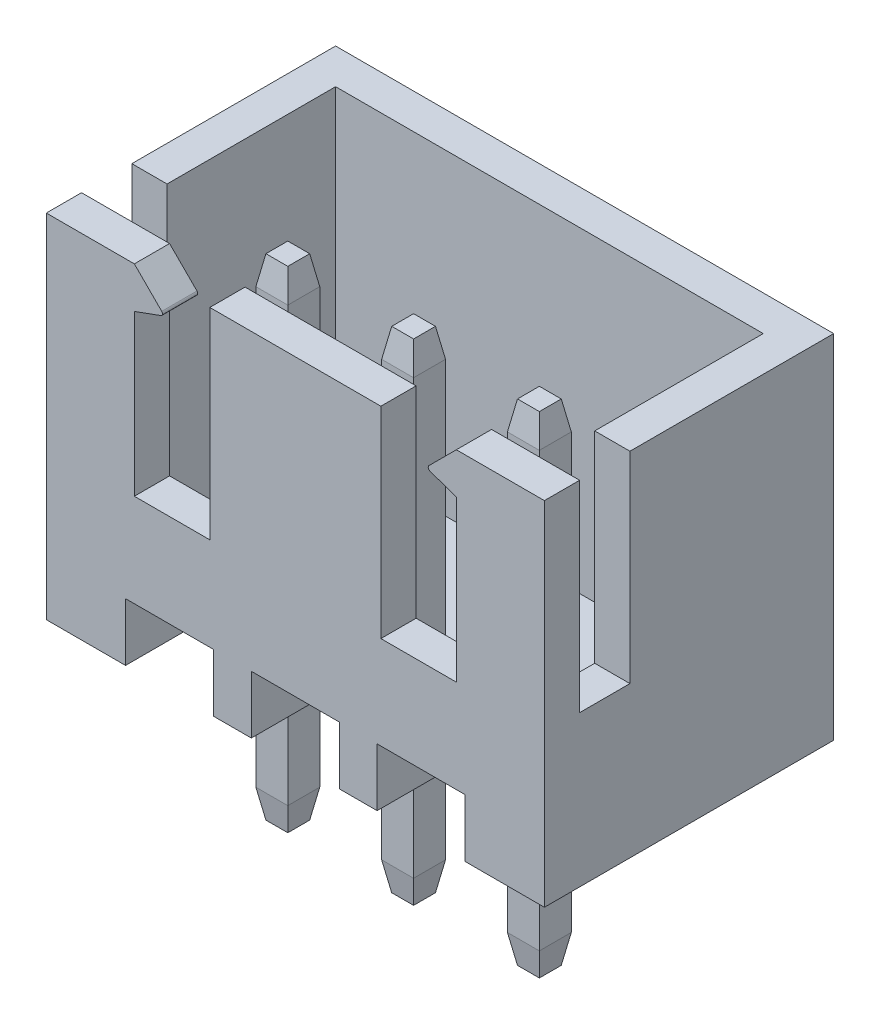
ISO-10303-21;
HEADER;
FILE_DESCRIPTION(('STEP AP214'),'2;1');
FILE_NAME('part.step','',(''),(''),'','','');
FILE_SCHEMA(('AUTOMOTIVE_DESIGN { 1 0 10303 214 1 1 1 1 }'));
ENDSEC;
DATA;
#1=APPLICATION_CONTEXT('core data for automotive mechanical design processes');
#2=APPLICATION_PROTOCOL_DEFINITION('international standard','automotive_design',2000,#1);
#3=PRODUCT_CONTEXT('',#1,'mechanical');
#4=PRODUCT('Part','Part','',(#3));
#5=PRODUCT_RELATED_PRODUCT_CATEGORY('part','',(#4));
#6=PRODUCT_DEFINITION_FORMATION('','',#4);
#7=PRODUCT_DEFINITION_CONTEXT('part definition',#1,'design');
#8=PRODUCT_DEFINITION('design','',#6,#7);
#9=PRODUCT_DEFINITION_SHAPE('','',#8);
#10=(LENGTH_UNIT() NAMED_UNIT(*) SI_UNIT(.MILLI.,.METRE.));
#11=(NAMED_UNIT(*) PLANE_ANGLE_UNIT() SI_UNIT($,.RADIAN.));
#12=(NAMED_UNIT(*) SI_UNIT($,.STERADIAN.) SOLID_ANGLE_UNIT());
#13=UNCERTAINTY_MEASURE_WITH_UNIT(LENGTH_MEASURE(1.E-05),#10,'distance_accuracy_value','');
#14=(GEOMETRIC_REPRESENTATION_CONTEXT(3) GLOBAL_UNCERTAINTY_ASSIGNED_CONTEXT((#13)) GLOBAL_UNIT_ASSIGNED_CONTEXT((#10,
#11,#12)) REPRESENTATION_CONTEXT('',''));
#15=CARTESIAN_POINT('',(0.,0.,0.));
#16=DIRECTION('',(0.,0.,1.));
#17=DIRECTION('',(1.,0.,0.));
#18=AXIS2_PLACEMENT_3D('',#15,#16,#17);
#19=CARTESIAN_POINT('',(2.1825,-3.4,0.842500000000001));
#20=DIRECTION('',(0.,0.,-1.));
#21=DIRECTION('',(-1.,0.,0.));
#22=AXIS2_PLACEMENT_3D('',#19,#20,#21);
#23=PLANE('',#22);
#24=DIRECTION('',(-1.,0.,0.));
#25=VECTOR('',#24,1.);
#26=CARTESIAN_POINT('',(2.1825,0.,0.842500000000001));
#27=LINE('',#26,#25);
#28=CARTESIAN_POINT('',(2.8175,0.,0.842500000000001));
#29=VERTEX_POINT('',#28);
#30=CARTESIAN_POINT('',(2.1825,0.,0.842500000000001));
#31=VERTEX_POINT('',#30);
#32=EDGE_CURVE('E45',#29,#31,#27,.T.);
#33=ORIENTED_EDGE('',*,*,#32,.F.);
#34=DIRECTION('',(0.,1.,0.));
#35=VECTOR('',#34,1.);
#36=CARTESIAN_POINT('',(2.8175,-3.4,0.842500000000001));
#37=LINE('',#36,#35);
#38=CARTESIAN_POINT('',(2.8175,0.100000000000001,0.842500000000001));
#39=VERTEX_POINT('',#38);
#40=EDGE_CURVE('E1166',#29,#39,#37,.T.);
#41=ORIENTED_EDGE('',*,*,#40,.T.);
#42=DIRECTION('',(-1.,0.,0.));
#43=VECTOR('',#42,1.);
#44=CARTESIAN_POINT('',(1.625,0.100000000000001,0.842500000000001));
#45=LINE('',#44,#43);
#46=CARTESIAN_POINT('',(2.1825,0.100000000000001,0.842500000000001));
#47=VERTEX_POINT('',#46);
#48=EDGE_CURVE('E709',#39,#47,#45,.T.);
#49=ORIENTED_EDGE('',*,*,#48,.T.);
#50=DIRECTION('',(0.,1.,0.));
#51=VECTOR('',#50,1.);
#52=CARTESIAN_POINT('',(2.1825,-3.4,0.842500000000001));
#53=LINE('',#52,#51);
#54=EDGE_CURVE('E1171',#31,#47,#53,.T.);
#55=ORIENTED_EDGE('',*,*,#54,.F.);
#56=EDGE_LOOP('',(#33,#41,#49,#55));
#57=FACE_BOUND('',#56,.T.);
#58=ADVANCED_FACE('F30',(#57),#23,.F.);
#59=CARTESIAN_POINT('',(2.8175,-3.4,0.842500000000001));
#60=DIRECTION('',(-1.,0.,0.));
#61=DIRECTION('',(0.,0.,1.));
#62=AXIS2_PLACEMENT_3D('',#59,#60,#61);
#63=PLANE('',#62);
#64=DIRECTION('',(0.,0.,1.));
#65=VECTOR('',#64,1.);
#66=CARTESIAN_POINT('',(2.8175,0.,0.842500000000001));
#67=LINE('',#66,#65);
#68=CARTESIAN_POINT('',(2.8175,0.,0.207500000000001));
#69=VERTEX_POINT('',#68);
#70=EDGE_CURVE('E52',#69,#29,#67,.T.);
#71=ORIENTED_EDGE('',*,*,#70,.F.);
#72=DIRECTION('',(0.,1.,0.));
#73=VECTOR('',#72,1.);
#74=CARTESIAN_POINT('',(2.8175,-3.4,0.207500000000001));
#75=LINE('',#74,#73);
#76=CARTESIAN_POINT('',(2.8175,0.100000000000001,0.207500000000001));
#77=VERTEX_POINT('',#76);
#78=EDGE_CURVE('E578',#69,#77,#75,.T.);
#79=ORIENTED_EDGE('',*,*,#78,.T.);
#80=DIRECTION('',(0.,0.,1.));
#81=VECTOR('',#80,1.);
#82=CARTESIAN_POINT('',(2.8175,0.100000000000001,-1.375));
#83=LINE('',#82,#81);
#84=EDGE_CURVE('E706',#77,#39,#83,.T.);
#85=ORIENTED_EDGE('',*,*,#84,.T.);
#86=ORIENTED_EDGE('',*,*,#40,.F.);
#87=EDGE_LOOP('',(#71,#79,#85,#86));
#88=FACE_BOUND('',#87,.T.);
#89=ADVANCED_FACE('F1240',(#88),#63,.F.);
#90=CARTESIAN_POINT('',(2.1825,-3.4,0.207500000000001));
#91=DIRECTION('',(0.,0.,1.));
#92=DIRECTION('',(1.,0.,0.));
#93=AXIS2_PLACEMENT_3D('',#90,#91,#92);
#94=PLANE('',#93);
#95=DIRECTION('',(1.,0.,0.));
#96=VECTOR('',#95,1.);
#97=CARTESIAN_POINT('',(2.1825,0.,0.207500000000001));
#98=LINE('',#97,#96);
#99=CARTESIAN_POINT('',(2.1825,0.,0.207500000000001));
#100=VERTEX_POINT('',#99);
#101=EDGE_CURVE('E576',#100,#69,#98,.T.);
#102=ORIENTED_EDGE('',*,*,#101,.F.);
#103=DIRECTION('',(0.,1.,0.));
#104=VECTOR('',#103,1.);
#105=CARTESIAN_POINT('',(2.1825,-3.4,0.207500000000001));
#106=LINE('',#105,#104);
#107=CARTESIAN_POINT('',(2.1825,0.100000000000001,0.207500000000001));
#108=VERTEX_POINT('',#107);
#109=EDGE_CURVE('E563',#100,#108,#106,.T.);
#110=ORIENTED_EDGE('',*,*,#109,.T.);
#111=DIRECTION('',(1.,0.,0.));
#112=VECTOR('',#111,1.);
#113=CARTESIAN_POINT('',(1.625,0.100000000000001,0.207500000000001));
#114=LINE('',#113,#112);
#115=EDGE_CURVE('E704',#108,#77,#114,.T.);
#116=ORIENTED_EDGE('',*,*,#115,.T.);
#117=ORIENTED_EDGE('',*,*,#78,.F.);
#118=EDGE_LOOP('',(#102,#110,#116,#117));
#119=FACE_BOUND('',#118,.T.);
#120=ADVANCED_FACE('F577',(#119),#94,.F.);
#121=CARTESIAN_POINT('',(2.1825,-3.4,0.842500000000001));
#122=DIRECTION('',(1.,0.,0.));
#123=DIRECTION('',(0.,0.,-1.));
#124=AXIS2_PLACEMENT_3D('',#121,#122,#123);
#125=PLANE('',#124);
#126=DIRECTION('',(0.,0.,-1.));
#127=VECTOR('',#126,1.);
#128=CARTESIAN_POINT('',(2.1825,0.,0.842500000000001));
#129=LINE('',#128,#127);
#130=EDGE_CURVE('E38',#31,#100,#129,.T.);
#131=ORIENTED_EDGE('',*,*,#130,.F.);
#132=ORIENTED_EDGE('',*,*,#54,.T.);
#133=DIRECTION('',(0.,0.,-1.));
#134=VECTOR('',#133,1.);
#135=CARTESIAN_POINT('',(2.1825,0.100000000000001,-1.375));
#136=LINE('',#135,#134);
#137=EDGE_CURVE('E568',#47,#108,#136,.T.);
#138=ORIENTED_EDGE('',*,*,#137,.T.);
#139=ORIENTED_EDGE('',*,*,#109,.F.);
#140=EDGE_LOOP('',(#131,#132,#138,#139));
#141=FACE_BOUND('',#140,.T.);
#142=ADVANCED_FACE('F565',(#141),#125,.F.);
#143=CARTESIAN_POINT('',(-4.95,7.,-2.875));
#144=DIRECTION('',(0.,1.,0.));
#145=DIRECTION('',(0.,0.,1.));
#146=AXIS2_PLACEMENT_3D('',#143,#144,#145);
#147=PLANE('',#146);
#148=DIRECTION('',(1.,0.,0.));
#149=VECTOR('',#148,1.);
#150=CARTESIAN_POINT('',(-10.,7.,1.175));
#151=LINE('',#150,#149);
#152=CARTESIAN_POINT('',(4.25,7.,1.175));
#153=VERTEX_POINT('',#152);
#154=CARTESIAN_POINT('',(4.95,7.,1.175));
#155=VERTEX_POINT('',#154);
#156=EDGE_CURVE('E1203',#153,#155,#151,.T.);
#157=ORIENTED_EDGE('',*,*,#156,.T.);
#158=DIRECTION('',(0.,0.,-1.));
#159=VECTOR('',#158,1.);
#160=CARTESIAN_POINT('',(4.95,7.,-2.875));
#161=LINE('',#160,#159);
#162=CARTESIAN_POINT('',(4.95,7.,-2.875));
#163=VERTEX_POINT('',#162);
#164=EDGE_CURVE('E811',#155,#163,#161,.T.);
#165=ORIENTED_EDGE('',*,*,#164,.T.);
#166=DIRECTION('',(-1.,0.,0.));
#167=VECTOR('',#166,1.);
#168=CARTESIAN_POINT('',(-4.95,7.,-2.875));
#169=LINE('',#168,#167);
#170=CARTESIAN_POINT('',(-4.95,7.,-2.875));
#171=VERTEX_POINT('',#170);
#172=EDGE_CURVE('E806',#163,#171,#169,.T.);
#173=ORIENTED_EDGE('',*,*,#172,.T.);
#174=DIRECTION('',(0.,0.,1.));
#175=VECTOR('',#174,1.);
#176=CARTESIAN_POINT('',(-4.95,7.,-2.875));
#177=LINE('',#176,#175);
#178=CARTESIAN_POINT('',(-4.95,7.,1.175));
#179=VERTEX_POINT('',#178);
#180=EDGE_CURVE('E817',#171,#179,#177,.T.);
#181=ORIENTED_EDGE('',*,*,#180,.T.);
#182=CARTESIAN_POINT('',(-4.25,7.,1.175));
#183=VERTEX_POINT('',#182);
#184=EDGE_CURVE('E1193',#179,#183,#151,.T.);
#185=ORIENTED_EDGE('',*,*,#184,.T.);
#186=DIRECTION('',(0.,0.,1.));
#187=VECTOR('',#186,1.);
#188=CARTESIAN_POINT('',(-4.25,7.,-2.875));
#189=LINE('',#188,#187);
#190=CARTESIAN_POINT('',(-4.25,7.,-2.175));
#191=VERTEX_POINT('',#190);
#192=EDGE_CURVE('E849',#191,#183,#189,.T.);
#193=ORIENTED_EDGE('',*,*,#192,.F.);
#194=DIRECTION('',(-1.,0.,0.));
#195=VECTOR('',#194,1.);
#196=CARTESIAN_POINT('',(-4.95,7.,-2.175));
#197=LINE('',#196,#195);
#198=CARTESIAN_POINT('',(4.25,7.,-2.175));
#199=VERTEX_POINT('',#198);
#200=EDGE_CURVE('E839',#199,#191,#197,.T.);
#201=ORIENTED_EDGE('',*,*,#200,.F.);
#202=DIRECTION('',(0.,0.,-1.));
#203=VECTOR('',#202,1.);
#204=CARTESIAN_POINT('',(4.25,7.,-2.875));
#205=LINE('',#204,#203);
#206=EDGE_CURVE('E842',#153,#199,#205,.T.);
#207=ORIENTED_EDGE('',*,*,#206,.F.);
#208=EDGE_LOOP('',(#157,#165,#173,#181,#185,#193,#201,#207));
#209=FACE_BOUND('',#208,.T.);
#210=ADVANCED_FACE('F1390',(#209),#147,.T.);
#211=DIRECTION('',(1.,0.,0.));
#212=VECTOR('',#211,1.);
#213=CARTESIAN_POINT('',(-4.95,7.,2.175));
#214=LINE('',#213,#212);
#215=CARTESIAN_POINT('',(-4.95,7.,2.175));
#216=VERTEX_POINT('',#215);
#217=CARTESIAN_POINT('',(-3.2,7.,2.175));
#218=VERTEX_POINT('',#217);
#219=EDGE_CURVE('E844',#216,#218,#214,.T.);
#220=ORIENTED_EDGE('',*,*,#219,.F.);
#221=CARTESIAN_POINT('',(-4.95,7.,2.875));
#222=VERTEX_POINT('',#221);
#223=EDGE_CURVE('E820',#216,#222,#177,.T.);
#224=ORIENTED_EDGE('',*,*,#223,.T.);
#225=DIRECTION('',(1.,0.,0.));
#226=VECTOR('',#225,1.);
#227=CARTESIAN_POINT('',(-4.95,7.,2.875));
#228=LINE('',#227,#226);
#229=CARTESIAN_POINT('',(-3.2,7.,2.875));
#230=VERTEX_POINT('',#229);
#231=EDGE_CURVE('E812',#222,#230,#228,.T.);
#232=ORIENTED_EDGE('',*,*,#231,.T.);
#233=DIRECTION('',(0.,0.,1.));
#234=VECTOR('',#233,1.);
#235=CARTESIAN_POINT('',(-3.2,7.,-2.09700187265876));
#236=LINE('',#235,#234);
#237=EDGE_CURVE('E1052',#218,#230,#236,.T.);
#238=ORIENTED_EDGE('',*,*,#237,.F.);
#239=EDGE_LOOP('',(#220,#224,#232,#238));
#240=FACE_BOUND('',#239,.T.);
#241=ADVANCED_FACE('F1313',(#240),#147,.T.);
#242=CARTESIAN_POINT('',(-4.95,0.7,-2.875));
#243=DIRECTION('',(0.,1.,0.));
#244=DIRECTION('',(0.,0.,1.));
#245=AXIS2_PLACEMENT_3D('',#242,#243,#244);
#246=PLANE('',#245);
#247=DIRECTION('',(-1.,0.,0.));
#248=VECTOR('',#247,1.);
#249=CARTESIAN_POINT('',(-4.95,0.7,0.842500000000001));
#250=LINE('',#249,#248);
#251=CARTESIAN_POINT('',(-2.1825,0.7,0.842500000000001));
#252=VERTEX_POINT('',#251);
#253=CARTESIAN_POINT('',(-2.8175,0.7,0.842500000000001));
#254=VERTEX_POINT('',#253);
#255=EDGE_CURVE('E1131',#252,#254,#250,.T.);
#256=ORIENTED_EDGE('',*,*,#255,.T.);
#257=DIRECTION('',(0.,0.,-1.));
#258=VECTOR('',#257,1.);
#259=CARTESIAN_POINT('',(-2.8175,0.7,-2.875));
#260=LINE('',#259,#258);
#261=CARTESIAN_POINT('',(-2.8175,0.7,0.207500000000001));
#262=VERTEX_POINT('',#261);
#263=EDGE_CURVE('E736',#254,#262,#260,.T.);
#264=ORIENTED_EDGE('',*,*,#263,.T.);
#265=DIRECTION('',(1.,0.,0.));
#266=VECTOR('',#265,1.);
#267=CARTESIAN_POINT('',(-4.95,0.7,0.207500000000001));
#268=LINE('',#267,#266);
#269=CARTESIAN_POINT('',(-2.1825,0.7,0.207500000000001));
#270=VERTEX_POINT('',#269);
#271=EDGE_CURVE('E1125',#262,#270,#268,.T.);
#272=ORIENTED_EDGE('',*,*,#271,.T.);
#273=DIRECTION('',(0.,0.,1.));
#274=VECTOR('',#273,1.);
#275=CARTESIAN_POINT('',(-2.1825,0.7,-2.875));
#276=LINE('',#275,#274);
#277=EDGE_CURVE('E1128',#270,#252,#276,.T.);
#278=ORIENTED_EDGE('',*,*,#277,.T.);
#279=EDGE_LOOP('',(#256,#264,#272,#278));
#280=FACE_BOUND('',#279,.T.);
#281=DIRECTION('',(0.,0.,1.));
#282=VECTOR('',#281,1.);
#283=CARTESIAN_POINT('',(-4.25,0.7,-2.875));
#284=LINE('',#283,#282);
#285=CARTESIAN_POINT('',(-4.25,0.7,-2.175));
#286=VERTEX_POINT('',#285);
#287=CARTESIAN_POINT('',(-4.25,0.7,2.175));
#288=VERTEX_POINT('',#287);
#289=EDGE_CURVE('E864',#286,#288,#284,.T.);
#290=ORIENTED_EDGE('',*,*,#289,.T.);
#291=DIRECTION('',(1.,0.,0.));
#292=VECTOR('',#291,1.);
#293=CARTESIAN_POINT('',(-4.95,0.7,2.175));
#294=LINE('',#293,#292);
#295=CARTESIAN_POINT('',(4.25,0.7,2.175));
#296=VERTEX_POINT('',#295);
#297=EDGE_CURVE('E860',#288,#296,#294,.T.);
#298=ORIENTED_EDGE('',*,*,#297,.T.);
#299=DIRECTION('',(0.,0.,-1.));
#300=VECTOR('',#299,1.);
#301=CARTESIAN_POINT('',(4.25,0.7,-2.875));
#302=LINE('',#301,#300);
#303=CARTESIAN_POINT('',(4.25,0.7,-2.175));
#304=VERTEX_POINT('',#303);
#305=EDGE_CURVE('E854',#296,#304,#302,.T.);
#306=ORIENTED_EDGE('',*,*,#305,.T.);
#307=DIRECTION('',(-1.,0.,0.));
#308=VECTOR('',#307,1.);
#309=CARTESIAN_POINT('',(-4.95,0.7,-2.175));
#310=LINE('',#309,#308);
#311=EDGE_CURVE('E852',#304,#286,#310,.T.);
#312=ORIENTED_EDGE('',*,*,#311,.T.);
#313=EDGE_LOOP('',(#290,#298,#306,#312));
#314=FACE_BOUND('',#313,.T.);
#315=DIRECTION('',(-1.,0.,0.));
#316=VECTOR('',#315,1.);
#317=CARTESIAN_POINT('',(-4.95,0.7,0.8425));
#318=LINE('',#317,#316);
#319=CARTESIAN_POINT('',(0.3175,0.7,0.842500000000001));
#320=VERTEX_POINT('',#319);
#321=CARTESIAN_POINT('',(-0.3175,0.7,0.842500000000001));
#322=VERTEX_POINT('',#321);
#323=EDGE_CURVE('E1109',#320,#322,#318,.T.);
#324=ORIENTED_EDGE('',*,*,#323,.T.);
#325=DIRECTION('',(0.,0.,-1.));
#326=VECTOR('',#325,1.);
#327=CARTESIAN_POINT('',(-0.3175,0.7,-2.875));
#328=LINE('',#327,#326);
#329=CARTESIAN_POINT('',(-0.3175,0.7,0.207500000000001));
#330=VERTEX_POINT('',#329);
#331=EDGE_CURVE('E1055',#322,#330,#328,.T.);
#332=ORIENTED_EDGE('',*,*,#331,.T.);
#333=DIRECTION('',(1.,0.,0.));
#334=VECTOR('',#333,1.);
#335=CARTESIAN_POINT('',(-4.95,0.7,0.207500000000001));
#336=LINE('',#335,#334);
#337=CARTESIAN_POINT('',(0.3175,0.7,0.207500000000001));
#338=VERTEX_POINT('',#337);
#339=EDGE_CURVE('E1103',#330,#338,#336,.T.);
#340=ORIENTED_EDGE('',*,*,#339,.T.);
#341=DIRECTION('',(0.,0.,1.));
#342=VECTOR('',#341,1.);
#343=CARTESIAN_POINT('',(0.3175,0.7,-2.875));
#344=LINE('',#343,#342);
#345=EDGE_CURVE('E1106',#338,#320,#344,.T.);
#346=ORIENTED_EDGE('',*,*,#345,.T.);
#347=EDGE_LOOP('',(#324,#332,#340,#346));
#348=FACE_BOUND('',#347,.T.);
#349=DIRECTION('',(-1.,0.,0.));
#350=VECTOR('',#349,1.);
#351=CARTESIAN_POINT('',(-4.95,0.7,0.8425));
#352=LINE('',#351,#350);
#353=CARTESIAN_POINT('',(2.8175,0.7,0.842500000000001));
#354=VERTEX_POINT('',#353);
#355=CARTESIAN_POINT('',(2.1825,0.7,0.842500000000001));
#356=VERTEX_POINT('',#355);
#357=EDGE_CURVE('E1155',#354,#356,#352,.T.);
#358=ORIENTED_EDGE('',*,*,#357,.T.);
#359=DIRECTION('',(0.,0.,-1.));
#360=VECTOR('',#359,1.);
#361=CARTESIAN_POINT('',(2.1825,0.7,-2.875));
#362=LINE('',#361,#360);
#363=CARTESIAN_POINT('',(2.1825,0.7,0.207500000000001));
#364=VERTEX_POINT('',#363);
#365=EDGE_CURVE('E1146',#356,#364,#362,.T.);
#366=ORIENTED_EDGE('',*,*,#365,.T.);
#367=DIRECTION('',(1.,0.,0.));
#368=VECTOR('',#367,1.);
#369=CARTESIAN_POINT('',(-4.95,0.7,0.207500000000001));
#370=LINE('',#369,#368);
#371=CARTESIAN_POINT('',(2.8175,0.7,0.207500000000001));
#372=VERTEX_POINT('',#371);
#373=EDGE_CURVE('E1149',#364,#372,#370,.T.);
#374=ORIENTED_EDGE('',*,*,#373,.T.);
#375=DIRECTION('',(0.,0.,1.));
#376=VECTOR('',#375,1.);
#377=CARTESIAN_POINT('',(2.8175,0.7,-2.875));
#378=LINE('',#377,#376);
#379=EDGE_CURVE('E1152',#372,#354,#378,.T.);
#380=ORIENTED_EDGE('',*,*,#379,.T.);
#381=EDGE_LOOP('',(#358,#366,#374,#380));
#382=FACE_BOUND('',#381,.T.);
#383=ADVANCED_FACE('F1297',(#280,#314,#348,#382),#246,.T.);
#384=CARTESIAN_POINT('',(1.625,0.100000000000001,-1.375));
#385=DIRECTION('',(0.,1.,0.));
#386=DIRECTION('',(0.,0.,1.));
#387=AXIS2_PLACEMENT_3D('',#384,#385,#386);
#388=PLANE('',#387);
#389=DIRECTION('',(0.,0.,1.));
#390=VECTOR('',#389,1.);
#391=CARTESIAN_POINT('',(3.375,0.100000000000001,-1.375));
#392=LINE('',#391,#390);
#393=CARTESIAN_POINT('',(3.375,0.100000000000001,-1.375));
#394=VERTEX_POINT('',#393);
#395=CARTESIAN_POINT('',(3.375,0.100000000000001,1.375));
#396=VERTEX_POINT('',#395);
#397=EDGE_CURVE('E985',#394,#396,#392,.T.);
#398=ORIENTED_EDGE('',*,*,#397,.T.);
#399=DIRECTION('',(1.,0.,0.));
#400=VECTOR('',#399,1.);
#401=CARTESIAN_POINT('',(1.625,0.100000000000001,1.375));
#402=LINE('',#401,#400);
#403=CARTESIAN_POINT('',(1.625,0.100000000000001,1.375));
#404=VERTEX_POINT('',#403);
#405=EDGE_CURVE('E963',#404,#396,#402,.T.);
#406=ORIENTED_EDGE('',*,*,#405,.F.);
#407=DIRECTION('',(0.,0.,1.));
#408=VECTOR('',#407,1.);
#409=CARTESIAN_POINT('',(1.625,0.100000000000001,-1.375));
#410=LINE('',#409,#408);
#411=CARTESIAN_POINT('',(1.625,0.100000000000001,-1.375));
#412=VERTEX_POINT('',#411);
#413=EDGE_CURVE('E969',#412,#404,#410,.T.);
#414=ORIENTED_EDGE('',*,*,#413,.F.);
#415=DIRECTION('',(1.,0.,0.));
#416=VECTOR('',#415,1.);
#417=CARTESIAN_POINT('',(1.625,0.100000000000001,-1.375));
#418=LINE('',#417,#416);
#419=EDGE_CURVE('E960',#412,#394,#418,.T.);
#420=ORIENTED_EDGE('',*,*,#419,.T.);
#421=EDGE_LOOP('',(#398,#406,#414,#420));
#422=FACE_BOUND('',#421,.T.);
#423=ORIENTED_EDGE('',*,*,#137,.F.);
#424=ORIENTED_EDGE('',*,*,#48,.F.);
#425=ORIENTED_EDGE('',*,*,#84,.F.);
#426=ORIENTED_EDGE('',*,*,#115,.F.);
#427=EDGE_LOOP('',(#423,#424,#425,#426));
#428=FACE_BOUND('',#427,.T.);
#429=ADVANCED_FACE('F1301',(#422,#428),#388,.F.);
#430=CARTESIAN_POINT('',(-3.375,0.100000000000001,-1.375));
#431=DIRECTION('',(0.,1.,0.));
#432=DIRECTION('',(0.,0.,1.));
#433=AXIS2_PLACEMENT_3D('',#430,#431,#432);
#434=PLANE('',#433);
#435=DIRECTION('',(0.,0.,1.));
#436=VECTOR('',#435,1.);
#437=CARTESIAN_POINT('',(-1.625,0.100000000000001,-1.375));
#438=LINE('',#437,#436);
#439=CARTESIAN_POINT('',(-1.625,0.100000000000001,-1.375));
#440=VERTEX_POINT('',#439);
#441=CARTESIAN_POINT('',(-1.625,0.100000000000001,1.375));
#442=VERTEX_POINT('',#441);
#443=EDGE_CURVE('E942',#440,#442,#438,.T.);
#444=ORIENTED_EDGE('',*,*,#443,.T.);
#445=DIRECTION('',(1.,0.,0.));
#446=VECTOR('',#445,1.);
#447=CARTESIAN_POINT('',(-3.375,0.100000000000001,1.375));
#448=LINE('',#447,#446);
#449=CARTESIAN_POINT('',(-3.375,0.100000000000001,1.375));
#450=VERTEX_POINT('',#449);
#451=EDGE_CURVE('E920',#450,#442,#448,.T.);
#452=ORIENTED_EDGE('',*,*,#451,.F.);
#453=DIRECTION('',(0.,0.,1.));
#454=VECTOR('',#453,1.);
#455=CARTESIAN_POINT('',(-3.375,0.100000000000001,-1.375));
#456=LINE('',#455,#454);
#457=CARTESIAN_POINT('',(-3.375,0.100000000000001,-1.375));
#458=VERTEX_POINT('',#457);
#459=EDGE_CURVE('E926',#458,#450,#456,.T.);
#460=ORIENTED_EDGE('',*,*,#459,.F.);
#461=DIRECTION('',(1.,0.,0.));
#462=VECTOR('',#461,1.);
#463=CARTESIAN_POINT('',(-3.375,0.100000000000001,-1.375));
#464=LINE('',#463,#462);
#465=EDGE_CURVE('E917',#458,#440,#464,.T.);
#466=ORIENTED_EDGE('',*,*,#465,.T.);
#467=EDGE_LOOP('',(#444,#452,#460,#466));
#468=FACE_BOUND('',#467,.T.);
#469=DIRECTION('',(0.,0.,-1.));
#470=VECTOR('',#469,1.);
#471=CARTESIAN_POINT('',(-2.8175,0.100000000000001,-1.375));
#472=LINE('',#471,#470);
#473=CARTESIAN_POINT('',(-2.8175,0.100000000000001,0.842500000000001));
#474=VERTEX_POINT('',#473);
#475=CARTESIAN_POINT('',(-2.8175,0.100000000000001,0.207500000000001));
#476=VERTEX_POINT('',#475);
#477=EDGE_CURVE('E712',#474,#476,#472,.T.);
#478=ORIENTED_EDGE('',*,*,#477,.F.);
#479=DIRECTION('',(-1.,0.,0.));
#480=VECTOR('',#479,1.);
#481=CARTESIAN_POINT('',(-3.375,0.100000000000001,0.842500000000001));
#482=LINE('',#481,#480);
#483=CARTESIAN_POINT('',(-2.1825,0.100000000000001,0.842500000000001));
#484=VERTEX_POINT('',#483);
#485=EDGE_CURVE('E721',#484,#474,#482,.T.);
#486=ORIENTED_EDGE('',*,*,#485,.F.);
#487=DIRECTION('',(0.,0.,1.));
#488=VECTOR('',#487,1.);
#489=CARTESIAN_POINT('',(-2.1825,0.100000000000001,-1.375));
#490=LINE('',#489,#488);
#491=CARTESIAN_POINT('',(-2.1825,0.100000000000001,0.207500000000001));
#492=VERTEX_POINT('',#491);
#493=EDGE_CURVE('E718',#492,#484,#490,.T.);
#494=ORIENTED_EDGE('',*,*,#493,.F.);
#495=DIRECTION('',(1.,0.,0.));
#496=VECTOR('',#495,1.);
#497=CARTESIAN_POINT('',(-3.375,0.100000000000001,0.207500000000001));
#498=LINE('',#497,#496);
#499=EDGE_CURVE('E715',#476,#492,#498,.T.);
#500=ORIENTED_EDGE('',*,*,#499,.F.);
#501=EDGE_LOOP('',(#478,#486,#494,#500));
#502=FACE_BOUND('',#501,.T.);
#503=ADVANCED_FACE('F1303',(#468,#502),#434,.F.);
#504=CARTESIAN_POINT('',(-0.875,0.100000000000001,-1.375));
#505=DIRECTION('',(0.,1.,0.));
#506=DIRECTION('',(0.,0.,1.));
#507=AXIS2_PLACEMENT_3D('',#504,#505,#506);
#508=PLANE('',#507);
#509=DIRECTION('',(0.,0.,1.));
#510=VECTOR('',#509,1.);
#511=CARTESIAN_POINT('',(0.875,0.100000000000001,-1.375));
#512=LINE('',#511,#510);
#513=CARTESIAN_POINT('',(0.875,0.100000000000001,-1.375));
#514=VERTEX_POINT('',#513);
#515=CARTESIAN_POINT('',(0.875,0.100000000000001,1.375));
#516=VERTEX_POINT('',#515);
#517=EDGE_CURVE('E899',#514,#516,#512,.T.);
#518=ORIENTED_EDGE('',*,*,#517,.T.);
#519=DIRECTION('',(1.,0.,0.));
#520=VECTOR('',#519,1.);
#521=CARTESIAN_POINT('',(-0.875,0.100000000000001,1.375));
#522=LINE('',#521,#520);
#523=CARTESIAN_POINT('',(-0.875,0.100000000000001,1.375));
#524=VERTEX_POINT('',#523);
#525=EDGE_CURVE('E876',#524,#516,#522,.T.);
#526=ORIENTED_EDGE('',*,*,#525,.F.);
#527=DIRECTION('',(0.,0.,1.));
#528=VECTOR('',#527,1.);
#529=CARTESIAN_POINT('',(-0.875,0.100000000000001,-1.375));
#530=LINE('',#529,#528);
#531=CARTESIAN_POINT('',(-0.875,0.100000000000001,-1.375));
#532=VERTEX_POINT('',#531);
#533=EDGE_CURVE('E882',#532,#524,#530,.T.);
#534=ORIENTED_EDGE('',*,*,#533,.F.);
#535=DIRECTION('',(1.,0.,0.));
#536=VECTOR('',#535,1.);
#537=CARTESIAN_POINT('',(-0.875,0.100000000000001,-1.375));
#538=LINE('',#537,#536);
#539=EDGE_CURVE('E873',#532,#514,#538,.T.);
#540=ORIENTED_EDGE('',*,*,#539,.T.);
#541=EDGE_LOOP('',(#518,#526,#534,#540));
#542=FACE_BOUND('',#541,.T.);
#543=DIRECTION('',(0.,0.,-1.));
#544=VECTOR('',#543,1.);
#545=CARTESIAN_POINT('',(-0.3175,0.100000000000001,-1.375));
#546=LINE('',#545,#544);
#547=CARTESIAN_POINT('',(-0.3175,0.100000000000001,0.842500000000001));
#548=VERTEX_POINT('',#547);
#549=CARTESIAN_POINT('',(-0.3175,0.100000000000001,0.207500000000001));
#550=VERTEX_POINT('',#549);
#551=EDGE_CURVE('E782',#548,#550,#546,.T.);
#552=ORIENTED_EDGE('',*,*,#551,.F.);
#553=DIRECTION('',(-1.,0.,0.));
#554=VECTOR('',#553,1.);
#555=CARTESIAN_POINT('',(-0.875,0.100000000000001,0.842500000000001));
#556=LINE('',#555,#554);
#557=CARTESIAN_POINT('',(0.3175,0.100000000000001,0.842500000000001));
#558=VERTEX_POINT('',#557);
#559=EDGE_CURVE('E791',#558,#548,#556,.T.);
#560=ORIENTED_EDGE('',*,*,#559,.F.);
#561=DIRECTION('',(0.,0.,1.));
#562=VECTOR('',#561,1.);
#563=CARTESIAN_POINT('',(0.3175,0.100000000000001,-1.375));
#564=LINE('',#563,#562);
#565=CARTESIAN_POINT('',(0.3175,0.100000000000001,0.207500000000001));
#566=VERTEX_POINT('',#565);
#567=EDGE_CURVE('E788',#566,#558,#564,.T.);
#568=ORIENTED_EDGE('',*,*,#567,.F.);
#569=DIRECTION('',(1.,0.,0.));
#570=VECTOR('',#569,1.);
#571=CARTESIAN_POINT('',(-0.875,0.100000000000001,0.207500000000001));
#572=LINE('',#571,#570);
#573=EDGE_CURVE('E785',#550,#566,#572,.T.);
#574=ORIENTED_EDGE('',*,*,#573,.F.);
#575=EDGE_LOOP('',(#552,#560,#568,#574));
#576=FACE_BOUND('',#575,.T.);
#577=ADVANCED_FACE('F1310',(#542,#576),#508,.F.);
#578=CARTESIAN_POINT('',(-4.95,7.,2.875));
#579=DIRECTION('',(0.,0.,-1.));
#580=DIRECTION('',(-1.,0.,0.));
#581=AXIS2_PLACEMENT_3D('',#578,#579,#580);
#582=PLANE('',#581);
#583=DIRECTION('',(0.,-1.,0.));
#584=VECTOR('',#583,1.);
#585=CARTESIAN_POINT('',(-1.7,7.,2.875));
#586=LINE('',#585,#584);
#587=CARTESIAN_POINT('',(-1.7,7.,2.875));
#588=VERTEX_POINT('',#587);
#589=CARTESIAN_POINT('',(-1.7,3.,2.875));
#590=VERTEX_POINT('',#589);
#591=EDGE_CURVE('E1071',#588,#590,#586,.T.);
#592=ORIENTED_EDGE('',*,*,#591,.T.);
#593=DIRECTION('',(-1.,0.,0.));
#594=VECTOR('',#593,1.);
#595=CARTESIAN_POINT('',(-1.7,3.,2.875));
#596=LINE('',#595,#594);
#597=CARTESIAN_POINT('',(-3.2,3.,2.875));
#598=VERTEX_POINT('',#597);
#599=EDGE_CURVE('E1068',#590,#598,#596,.T.);
#600=ORIENTED_EDGE('',*,*,#599,.T.);
#601=DIRECTION('',(0.,1.,0.));
#602=VECTOR('',#601,1.);
#603=CARTESIAN_POINT('',(-3.2,6.18161785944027,2.875));
#604=LINE('',#603,#602);
#605=CARTESIAN_POINT('',(-3.2,6.18161785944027,2.875));
#606=VERTEX_POINT('',#605);
#607=EDGE_CURVE('E1065',#598,#606,#604,.T.);
#608=ORIENTED_EDGE('',*,*,#607,.T.);
#609=DIRECTION('',(0.939692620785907,0.342020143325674,0.));
#610=VECTOR('',#609,1.);
#611=CARTESIAN_POINT('',(-3.2,6.18161785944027,2.875));
#612=LINE('',#611,#610);
#613=CARTESIAN_POINT('',(-2.67375109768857,6.3731567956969,2.875));
#614=VERTEX_POINT('',#613);
#615=EDGE_CURVE('E1062',#606,#614,#612,.T.);
#616=ORIENTED_EDGE('',*,*,#615,.T.);
#617=CARTESIAN_POINT('',(-2.69085210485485,6.42014142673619,2.875));
#618=DIRECTION('',(0.,0.,1.));
#619=DIRECTION('',(-1.,0.,0.));
#620=AXIS2_PLACEMENT_3D('',#617,#618,#619);
#621=CIRCLE('',#620,0.0500000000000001);
#622=CARTESIAN_POINT('',(-2.65549676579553,6.45549676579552,2.875));
#623=VERTEX_POINT('',#622);
#624=EDGE_CURVE('E1059',#614,#623,#621,.T.);
#625=ORIENTED_EDGE('',*,*,#624,.T.);
#626=DIRECTION('',(-0.707106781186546,0.70710678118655,0.));
#627=VECTOR('',#626,1.);
#628=CARTESIAN_POINT('',(-2.65549676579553,6.45549676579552,2.875));
#629=LINE('',#628,#627);
#630=EDGE_CURVE('E1058',#623,#230,#629,.T.);
#631=ORIENTED_EDGE('',*,*,#630,.T.);
#632=ORIENTED_EDGE('',*,*,#231,.F.);
#633=DIRECTION('',(0.,-1.,0.));
#634=VECTOR('',#633,1.);
#635=CARTESIAN_POINT('',(-4.95,7.,2.875));
#636=LINE('',#635,#634);
#637=CARTESIAN_POINT('',(-4.95,0.,2.875));
#638=VERTEX_POINT('',#637);
#639=EDGE_CURVE('E794',#222,#638,#636,.T.);
#640=ORIENTED_EDGE('',*,*,#639,.T.);
#641=DIRECTION('',(1.,0.,0.));
#642=VECTOR('',#641,1.);
#643=CARTESIAN_POINT('',(-4.95,0.,2.875));
#644=LINE('',#643,#642);
#645=CARTESIAN_POINT('',(-3.375,0.,2.875));
#646=VERTEX_POINT('',#645);
#647=EDGE_CURVE('E829',#638,#646,#644,.T.);
#648=ORIENTED_EDGE('',*,*,#647,.T.);
#649=DIRECTION('',(0.,-1.,0.));
#650=VECTOR('',#649,1.);
#651=CARTESIAN_POINT('',(-3.375,1.15,2.875));
#652=LINE('',#651,#650);
#653=CARTESIAN_POINT('',(-3.375,1.15,2.875));
#654=VERTEX_POINT('',#653);
#655=EDGE_CURVE('E937',#654,#646,#652,.T.);
#656=ORIENTED_EDGE('',*,*,#655,.F.);
#657=DIRECTION('',(1.,0.,0.));
#658=VECTOR('',#657,1.);
#659=CARTESIAN_POINT('',(-3.375,1.15,2.875));
#660=LINE('',#659,#658);
#661=CARTESIAN_POINT('',(-1.625,1.15,2.875));
#662=VERTEX_POINT('',#661);
#663=EDGE_CURVE('E914',#654,#662,#660,.T.);
#664=ORIENTED_EDGE('',*,*,#663,.T.);
#665=DIRECTION('',(0.,-1.,0.));
#666=VECTOR('',#665,1.);
#667=CARTESIAN_POINT('',(-1.625,1.15,2.875));
#668=LINE('',#667,#666);
#669=CARTESIAN_POINT('',(-1.625,0.,2.875));
#670=VERTEX_POINT('',#669);
#671=EDGE_CURVE('E954',#662,#670,#668,.T.);
#672=ORIENTED_EDGE('',*,*,#671,.T.);
#673=CARTESIAN_POINT('',(-0.875,0.,2.875));
#674=VERTEX_POINT('',#673);
#675=EDGE_CURVE('E832',#670,#674,#644,.T.);
#676=ORIENTED_EDGE('',*,*,#675,.T.);
#677=DIRECTION('',(0.,-1.,0.));
#678=VECTOR('',#677,1.);
#679=CARTESIAN_POINT('',(-0.875,1.15,2.875));
#680=LINE('',#679,#678);
#681=CARTESIAN_POINT('',(-0.875,1.15,2.875));
#682=VERTEX_POINT('',#681);
#683=EDGE_CURVE('E893',#682,#674,#680,.T.);
#684=ORIENTED_EDGE('',*,*,#683,.F.);
#685=DIRECTION('',(1.,0.,0.));
#686=VECTOR('',#685,1.);
#687=CARTESIAN_POINT('',(-0.875,1.15,2.875));
#688=LINE('',#687,#686);
#689=CARTESIAN_POINT('',(0.875,1.15,2.875));
#690=VERTEX_POINT('',#689);
#691=EDGE_CURVE('E870',#682,#690,#688,.T.);
#692=ORIENTED_EDGE('',*,*,#691,.T.);
#693=DIRECTION('',(0.,-1.,0.));
#694=VECTOR('',#693,1.);
#695=CARTESIAN_POINT('',(0.875,1.15,2.875));
#696=LINE('',#695,#694);
#697=CARTESIAN_POINT('',(0.875,0.,2.875));
#698=VERTEX_POINT('',#697);
#699=EDGE_CURVE('E911',#690,#698,#696,.T.);
#700=ORIENTED_EDGE('',*,*,#699,.T.);
#701=CARTESIAN_POINT('',(1.625,0.,2.875));
#702=VERTEX_POINT('',#701);
#703=EDGE_CURVE('E834',#698,#702,#644,.T.);
#704=ORIENTED_EDGE('',*,*,#703,.T.);
#705=DIRECTION('',(0.,-1.,0.));
#706=VECTOR('',#705,1.);
#707=CARTESIAN_POINT('',(1.625,1.15,2.875));
#708=LINE('',#707,#706);
#709=CARTESIAN_POINT('',(1.625,1.15,2.875));
#710=VERTEX_POINT('',#709);
#711=EDGE_CURVE('E980',#710,#702,#708,.T.);
#712=ORIENTED_EDGE('',*,*,#711,.F.);
#713=DIRECTION('',(1.,0.,0.));
#714=VECTOR('',#713,1.);
#715=CARTESIAN_POINT('',(1.625,1.15,2.875));
#716=LINE('',#715,#714);
#717=CARTESIAN_POINT('',(3.375,1.15,2.875));
#718=VERTEX_POINT('',#717);
#719=EDGE_CURVE('E957',#710,#718,#716,.T.);
#720=ORIENTED_EDGE('',*,*,#719,.T.);
#721=DIRECTION('',(0.,-1.,0.));
#722=VECTOR('',#721,1.);
#723=CARTESIAN_POINT('',(3.375,1.15,2.875));
#724=LINE('',#723,#722);
#725=CARTESIAN_POINT('',(3.375,0.,2.875));
#726=VERTEX_POINT('',#725);
#727=EDGE_CURVE('E997',#718,#726,#724,.T.);
#728=ORIENTED_EDGE('',*,*,#727,.T.);
#729=CARTESIAN_POINT('',(4.95,0.,2.875));
#730=VERTEX_POINT('',#729);
#731=EDGE_CURVE('E833',#726,#730,#644,.T.);
#732=ORIENTED_EDGE('',*,*,#731,.T.);
#733=DIRECTION('',(0.,-1.,0.));
#734=VECTOR('',#733,1.);
#735=CARTESIAN_POINT('',(4.95,7.,2.875));
#736=LINE('',#735,#734);
#737=CARTESIAN_POINT('',(4.95,7.,2.875));
#738=VERTEX_POINT('',#737);
#739=EDGE_CURVE('E797',#738,#730,#736,.T.);
#740=ORIENTED_EDGE('',*,*,#739,.F.);
#741=CARTESIAN_POINT('',(3.2,7.,2.875));
#742=VERTEX_POINT('',#741);
#743=EDGE_CURVE('E816',#742,#738,#228,.T.);
#744=ORIENTED_EDGE('',*,*,#743,.F.);
#745=DIRECTION('',(0.707106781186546,0.70710678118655,0.));
#746=VECTOR('',#745,1.);
#747=CARTESIAN_POINT('',(2.65549676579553,6.45549676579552,2.875));
#748=LINE('',#747,#746);
#749=CARTESIAN_POINT('',(2.65549676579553,6.45549676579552,2.875));
#750=VERTEX_POINT('',#749);
#751=EDGE_CURVE('E1034',#750,#742,#748,.T.);
#752=ORIENTED_EDGE('',*,*,#751,.F.);
#753=CARTESIAN_POINT('',(2.69085210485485,6.42014142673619,2.875));
#754=DIRECTION('',(0.,0.,-1.));
#755=DIRECTION('',(1.,0.,0.));
#756=AXIS2_PLACEMENT_3D('',#753,#754,#755);
#757=CIRCLE('',#756,0.0500000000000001);
#758=CARTESIAN_POINT('',(2.67375109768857,6.3731567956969,2.875));
#759=VERTEX_POINT('',#758);
#760=EDGE_CURVE('E1048',#759,#750,#757,.T.);
#761=ORIENTED_EDGE('',*,*,#760,.F.);
#762=DIRECTION('',(-0.939692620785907,0.342020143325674,0.));
#763=VECTOR('',#762,1.);
#764=CARTESIAN_POINT('',(3.2,6.18161785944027,2.875));
#765=LINE('',#764,#763);
#766=CARTESIAN_POINT('',(3.2,6.18161785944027,2.875));
#767=VERTEX_POINT('',#766);
#768=EDGE_CURVE('E1045',#767,#759,#765,.T.);
#769=ORIENTED_EDGE('',*,*,#768,.F.);
#770=DIRECTION('',(0.,1.,0.));
#771=VECTOR('',#770,1.);
#772=CARTESIAN_POINT('',(3.2,6.18161785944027,2.875));
#773=LINE('',#772,#771);
#774=CARTESIAN_POINT('',(3.2,3.,2.875));
#775=VERTEX_POINT('',#774);
#776=EDGE_CURVE('E1042',#775,#767,#773,.T.);
#777=ORIENTED_EDGE('',*,*,#776,.F.);
#778=DIRECTION('',(1.,0.,0.));
#779=VECTOR('',#778,1.);
#780=CARTESIAN_POINT('',(1.7,3.,2.875));
#781=LINE('',#780,#779);
#782=CARTESIAN_POINT('',(1.7,3.,2.875));
#783=VERTEX_POINT('',#782);
#784=EDGE_CURVE('E1038',#783,#775,#781,.T.);
#785=ORIENTED_EDGE('',*,*,#784,.F.);
#786=DIRECTION('',(0.,-1.,0.));
#787=VECTOR('',#786,1.);
#788=CARTESIAN_POINT('',(1.7,7.,2.875));
#789=LINE('',#788,#787);
#790=CARTESIAN_POINT('',(1.7,7.,2.875));
#791=VERTEX_POINT('',#790);
#792=EDGE_CURVE('E1035',#791,#783,#789,.T.);
#793=ORIENTED_EDGE('',*,*,#792,.F.);
#794=EDGE_CURVE('E815',#588,#791,#228,.T.);
#795=ORIENTED_EDGE('',*,*,#794,.F.);
#796=EDGE_LOOP('',(#592,#600,#608,#616,#625,#631,#632,#640,#648,#656,#664,#672,#676,#684,#692,
#700,#704,#712,#720,#728,#732,#740,#744,#752,#761,#769,#777,#785,#793,#795));
#797=FACE_BOUND('',#796,.T.);
#798=ADVANCED_FACE('F1357',(#797),#582,.F.);
#799=CARTESIAN_POINT('',(-1.7,7.,2.175));
#800=VERTEX_POINT('',#799);
#801=CARTESIAN_POINT('',(1.7,7.,2.175));
#802=VERTEX_POINT('',#801);
#803=EDGE_CURVE('E847',#800,#802,#214,.T.);
#804=ORIENTED_EDGE('',*,*,#803,.F.);
#805=DIRECTION('',(0.,0.,1.));
#806=VECTOR('',#805,1.);
#807=CARTESIAN_POINT('',(-1.7,7.,-2.09700187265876));
#808=LINE('',#807,#806);
#809=EDGE_CURVE('E1054',#800,#588,#808,.T.);
#810=ORIENTED_EDGE('',*,*,#809,.T.);
#811=ORIENTED_EDGE('',*,*,#794,.T.);
#812=DIRECTION('',(0.,0.,1.));
#813=VECTOR('',#812,1.);
#814=CARTESIAN_POINT('',(1.7,7.,-2.09700187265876));
#815=LINE('',#814,#813);
#816=EDGE_CURVE('E1000',#802,#791,#815,.T.);
#817=ORIENTED_EDGE('',*,*,#816,.F.);
#818=EDGE_LOOP('',(#804,#810,#811,#817));
#819=FACE_BOUND('',#818,.T.);
#820=ADVANCED_FACE('F1386',(#819),#147,.T.);
#821=CARTESIAN_POINT('',(4.95,7.,2.175));
#822=VERTEX_POINT('',#821);
#823=EDGE_CURVE('E808',#738,#822,#161,.T.);
#824=ORIENTED_EDGE('',*,*,#823,.T.);
#825=CARTESIAN_POINT('',(3.2,7.,2.175));
#826=VERTEX_POINT('',#825);
#827=EDGE_CURVE('E848',#826,#822,#214,.T.);
#828=ORIENTED_EDGE('',*,*,#827,.F.);
#829=DIRECTION('',(0.,0.,1.));
#830=VECTOR('',#829,1.);
#831=CARTESIAN_POINT('',(3.2,7.,-2.09700187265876));
#832=LINE('',#831,#830);
#833=EDGE_CURVE('E1003',#826,#742,#832,.T.);
#834=ORIENTED_EDGE('',*,*,#833,.T.);
#835=ORIENTED_EDGE('',*,*,#743,.T.);
#836=EDGE_LOOP('',(#824,#828,#834,#835));
#837=FACE_BOUND('',#836,.T.);
#838=ADVANCED_FACE('F1372',(#837),#147,.T.);
#839=CARTESIAN_POINT('',(-4.95,7.,2.175));
#840=DIRECTION('',(0.,0.,-1.));
#841=DIRECTION('',(-1.,0.,0.));
#842=AXIS2_PLACEMENT_3D('',#839,#840,#841);
#843=PLANE('',#842);
#844=DIRECTION('',(1.,0.,0.));
#845=VECTOR('',#844,1.);
#846=CARTESIAN_POINT('',(1.7,3.,2.175));
#847=LINE('',#846,#845);
#848=CARTESIAN_POINT('',(1.7,3.,2.175));
#849=VERTEX_POINT('',#848);
#850=CARTESIAN_POINT('',(3.2,3.,2.175));
#851=VERTEX_POINT('',#850);
#852=EDGE_CURVE('E1006',#849,#851,#847,.T.);
#853=ORIENTED_EDGE('',*,*,#852,.T.);
#854=DIRECTION('',(0.,1.,0.));
#855=VECTOR('',#854,1.);
#856=CARTESIAN_POINT('',(3.2,6.18161785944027,2.175));
#857=LINE('',#856,#855);
#858=CARTESIAN_POINT('',(3.2,6.18161785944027,2.175));
#859=VERTEX_POINT('',#858);
#860=EDGE_CURVE('E1010',#851,#859,#857,.T.);
#861=ORIENTED_EDGE('',*,*,#860,.T.);
#862=DIRECTION('',(-0.939692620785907,0.342020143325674,0.));
#863=VECTOR('',#862,1.);
#864=CARTESIAN_POINT('',(3.2,6.18161785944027,2.175));
#865=LINE('',#864,#863);
#866=CARTESIAN_POINT('',(2.67375109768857,6.3731567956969,2.175));
#867=VERTEX_POINT('',#866);
#868=EDGE_CURVE('E1013',#859,#867,#865,.T.);
#869=ORIENTED_EDGE('',*,*,#868,.T.);
#870=CARTESIAN_POINT('',(2.69085210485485,6.42014142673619,2.175));
#871=DIRECTION('',(0.,0.,-1.));
#872=DIRECTION('',(-1.,0.,0.));
#873=AXIS2_PLACEMENT_3D('',#870,#871,#872);
#874=CIRCLE('',#873,0.0500000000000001);
#875=CARTESIAN_POINT('',(2.65549676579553,6.45549676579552,2.175));
#876=VERTEX_POINT('',#875);
#877=EDGE_CURVE('E1016',#867,#876,#874,.T.);
#878=ORIENTED_EDGE('',*,*,#877,.T.);
#879=DIRECTION('',(0.707106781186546,0.70710678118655,0.));
#880=VECTOR('',#879,1.);
#881=CARTESIAN_POINT('',(2.65549676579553,6.45549676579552,2.175));
#882=LINE('',#881,#880);
#883=EDGE_CURVE('E1019',#876,#826,#882,.T.);
#884=ORIENTED_EDGE('',*,*,#883,.T.);
#885=ORIENTED_EDGE('',*,*,#827,.T.);
#886=DIRECTION('',(0.,1.,0.));
#887=VECTOR('',#886,1.);
#888=CARTESIAN_POINT('',(4.95,7.,2.175));
#889=LINE('',#888,#887);
#890=CARTESIAN_POINT('',(4.95,3.,2.175));
#891=VERTEX_POINT('',#890);
#892=EDGE_CURVE('E1190',#891,#822,#889,.T.);
#893=ORIENTED_EDGE('',*,*,#892,.F.);
#894=DIRECTION('',(1.,0.,0.));
#895=VECTOR('',#894,1.);
#896=CARTESIAN_POINT('',(-10.,3.,2.175));
#897=LINE('',#896,#895);
#898=CARTESIAN_POINT('',(4.25,3.,2.175));
#899=VERTEX_POINT('',#898);
#900=EDGE_CURVE('E1194',#899,#891,#897,.T.);
#901=ORIENTED_EDGE('',*,*,#900,.F.);
#902=DIRECTION('',(0.,-1.,0.));
#903=VECTOR('',#902,1.);
#904=CARTESIAN_POINT('',(4.25,7.,2.175));
#905=LINE('',#904,#903);
#906=EDGE_CURVE('E858',#899,#296,#905,.T.);
#907=ORIENTED_EDGE('',*,*,#906,.T.);
#908=ORIENTED_EDGE('',*,*,#297,.F.);
#909=DIRECTION('',(0.,-1.,0.));
#910=VECTOR('',#909,1.);
#911=CARTESIAN_POINT('',(-4.25,7.,2.175));
#912=LINE('',#911,#910);
#913=CARTESIAN_POINT('',(-4.25,3.,2.175));
#914=VERTEX_POINT('',#913);
#915=EDGE_CURVE('E838',#914,#288,#912,.T.);
#916=ORIENTED_EDGE('',*,*,#915,.F.);
#917=CARTESIAN_POINT('',(-4.95,3.,2.175));
#918=VERTEX_POINT('',#917);
#919=EDGE_CURVE('E1197',#918,#914,#897,.T.);
#920=ORIENTED_EDGE('',*,*,#919,.F.);
#921=DIRECTION('',(0.,-1.,0.));
#922=VECTOR('',#921,1.);
#923=CARTESIAN_POINT('',(-4.95,7.,2.175));
#924=LINE('',#923,#922);
#925=EDGE_CURVE('E1187',#216,#918,#924,.T.);
#926=ORIENTED_EDGE('',*,*,#925,.F.);
#927=ORIENTED_EDGE('',*,*,#219,.T.);
#928=DIRECTION('',(-0.707106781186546,0.70710678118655,0.));
#929=VECTOR('',#928,1.);
#930=CARTESIAN_POINT('',(-2.65549676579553,6.45549676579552,2.175));
#931=LINE('',#930,#929);
#932=CARTESIAN_POINT('',(-2.65549676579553,6.45549676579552,2.175));
#933=VERTEX_POINT('',#932);
#934=EDGE_CURVE('E1074',#933,#218,#931,.T.);
#935=ORIENTED_EDGE('',*,*,#934,.F.);
#936=CARTESIAN_POINT('',(-2.69085210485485,6.42014142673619,2.175));
#937=DIRECTION('',(0.,0.,-1.));
#938=DIRECTION('',(-1.,0.,0.));
#939=AXIS2_PLACEMENT_3D('',#936,#937,#938);
#940=CIRCLE('',#939,0.0500000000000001);
#941=CARTESIAN_POINT('',(-2.67375109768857,6.3731567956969,2.175));
#942=VERTEX_POINT('',#941);
#943=EDGE_CURVE('E1039',#942,#933,#940,.F.);
#944=ORIENTED_EDGE('',*,*,#943,.F.);
#945=DIRECTION('',(0.939692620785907,0.342020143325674,0.));
#946=VECTOR('',#945,1.);
#947=CARTESIAN_POINT('',(-3.2,6.18161785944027,2.175));
#948=LINE('',#947,#946);
#949=CARTESIAN_POINT('',(-3.2,6.18161785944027,2.175));
#950=VERTEX_POINT('',#949);
#951=EDGE_CURVE('E1085',#950,#942,#948,.T.);
#952=ORIENTED_EDGE('',*,*,#951,.F.);
#953=DIRECTION('',(0.,1.,0.));
#954=VECTOR('',#953,1.);
#955=CARTESIAN_POINT('',(-3.2,6.18161785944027,2.175));
#956=LINE('',#955,#954);
#957=CARTESIAN_POINT('',(-3.2,3.,2.175));
#958=VERTEX_POINT('',#957);
#959=EDGE_CURVE('E1082',#958,#950,#956,.T.);
#960=ORIENTED_EDGE('',*,*,#959,.F.);
#961=DIRECTION('',(-1.,0.,0.));
#962=VECTOR('',#961,1.);
#963=CARTESIAN_POINT('',(-1.7,3.,2.175));
#964=LINE('',#963,#962);
#965=CARTESIAN_POINT('',(-1.7,3.,2.175));
#966=VERTEX_POINT('',#965);
#967=EDGE_CURVE('E1079',#966,#958,#964,.T.);
#968=ORIENTED_EDGE('',*,*,#967,.F.);
#969=DIRECTION('',(0.,-1.,0.));
#970=VECTOR('',#969,1.);
#971=CARTESIAN_POINT('',(-1.7,7.,2.175));
#972=LINE('',#971,#970);
#973=EDGE_CURVE('E1076',#800,#966,#972,.T.);
#974=ORIENTED_EDGE('',*,*,#973,.F.);
#975=ORIENTED_EDGE('',*,*,#803,.T.);
#976=DIRECTION('',(0.,-1.,0.));
#977=VECTOR('',#976,1.);
#978=CARTESIAN_POINT('',(1.7,7.,2.175));
#979=LINE('',#978,#977);
#980=EDGE_CURVE('E1007',#802,#849,#979,.T.);
#981=ORIENTED_EDGE('',*,*,#980,.T.);
#982=EDGE_LOOP('',(#853,#861,#869,#878,#884,#885,#893,#901,#907,#908,#916,#920,#926,#927,#935,
#944,#952,#960,#968,#974,#975,#981));
#983=FACE_BOUND('',#982,.T.);
#984=ADVANCED_FACE('F1368',(#983),#843,.T.);
#985=CARTESIAN_POINT('',(-4.95,7.,-2.875));
#986=DIRECTION('',(0.,0.,1.));
#987=DIRECTION('',(1.,0.,0.));
#988=AXIS2_PLACEMENT_3D('',#985,#986,#987);
#989=PLANE('',#988);
#990=DIRECTION('',(0.,1.,0.));
#991=VECTOR('',#990,1.);
#992=CARTESIAN_POINT('',(1.625,1.15,-2.875));
#993=LINE('',#992,#991);
#994=CARTESIAN_POINT('',(1.625,0.,-2.875));
#995=VERTEX_POINT('',#994);
#996=CARTESIAN_POINT('',(1.625,1.15,-2.875));
#997=VERTEX_POINT('',#996);
#998=EDGE_CURVE('E975',#995,#997,#993,.T.);
#999=ORIENTED_EDGE('',*,*,#998,.F.);
#1000=DIRECTION('',(-1.,0.,0.));
#1001=VECTOR('',#1000,1.);
#1002=CARTESIAN_POINT('',(-4.95,0.,-2.875));
#1003=LINE('',#1002,#1001);
#1004=CARTESIAN_POINT('',(0.874999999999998,0.,-2.875));
#1005=VERTEX_POINT('',#1004);
#1006=EDGE_CURVE('E824',#995,#1005,#1003,.T.);
#1007=ORIENTED_EDGE('',*,*,#1006,.T.);
#1008=DIRECTION('',(0.,1.,0.));
#1009=VECTOR('',#1008,1.);
#1010=CARTESIAN_POINT('',(0.875,1.15,-2.875));
#1011=LINE('',#1010,#1009);
#1012=CARTESIAN_POINT('',(0.875,1.15,-2.875));
#1013=VERTEX_POINT('',#1012);
#1014=EDGE_CURVE('E905',#1005,#1013,#1011,.T.);
#1015=ORIENTED_EDGE('',*,*,#1014,.T.);
#1016=DIRECTION('',(1.,0.,0.));
#1017=VECTOR('',#1016,1.);
#1018=CARTESIAN_POINT('',(-0.875,1.15,-2.875));
#1019=LINE('',#1018,#1017);
#1020=CARTESIAN_POINT('',(-0.875,1.15,-2.875));
#1021=VERTEX_POINT('',#1020);
#1022=EDGE_CURVE('E871',#1021,#1013,#1019,.T.);
#1023=ORIENTED_EDGE('',*,*,#1022,.F.);
#1024=DIRECTION('',(0.,1.,0.));
#1025=VECTOR('',#1024,1.);
#1026=CARTESIAN_POINT('',(-0.875,1.15,-2.875));
#1027=LINE('',#1026,#1025);
#1028=CARTESIAN_POINT('',(-0.875,0.,-2.875));
#1029=VERTEX_POINT('',#1028);
#1030=EDGE_CURVE('E888',#1029,#1021,#1027,.T.);
#1031=ORIENTED_EDGE('',*,*,#1030,.F.);
#1032=CARTESIAN_POINT('',(-1.625,0.,-2.875));
#1033=VERTEX_POINT('',#1032);
#1034=EDGE_CURVE('E825',#1029,#1033,#1003,.T.);
#1035=ORIENTED_EDGE('',*,*,#1034,.T.);
#1036=DIRECTION('',(0.,1.,0.));
#1037=VECTOR('',#1036,1.);
#1038=CARTESIAN_POINT('',(-1.625,1.15,-2.875));
#1039=LINE('',#1038,#1037);
#1040=CARTESIAN_POINT('',(-1.625,1.15,-2.875));
#1041=VERTEX_POINT('',#1040);
#1042=EDGE_CURVE('E948',#1033,#1041,#1039,.T.);
#1043=ORIENTED_EDGE('',*,*,#1042,.T.);
#1044=DIRECTION('',(1.,0.,0.));
#1045=VECTOR('',#1044,1.);
#1046=CARTESIAN_POINT('',(-3.375,1.15,-2.875));
#1047=LINE('',#1046,#1045);
#1048=CARTESIAN_POINT('',(-3.375,1.15,-2.875));
#1049=VERTEX_POINT('',#1048);
#1050=EDGE_CURVE('E915',#1049,#1041,#1047,.T.);
#1051=ORIENTED_EDGE('',*,*,#1050,.F.);
#1052=DIRECTION('',(0.,1.,0.));
#1053=VECTOR('',#1052,1.);
#1054=CARTESIAN_POINT('',(-3.375,1.15,-2.875));
#1055=LINE('',#1054,#1053);
#1056=CARTESIAN_POINT('',(-3.375,0.,-2.875));
#1057=VERTEX_POINT('',#1056);
#1058=EDGE_CURVE('E932',#1057,#1049,#1055,.T.);
#1059=ORIENTED_EDGE('',*,*,#1058,.F.);
#1060=CARTESIAN_POINT('',(-4.95,0.,-2.875));
#1061=VERTEX_POINT('',#1060);
#1062=EDGE_CURVE('E828',#1057,#1061,#1003,.T.);
#1063=ORIENTED_EDGE('',*,*,#1062,.T.);
#1064=DIRECTION('',(0.,-1.,0.));
#1065=VECTOR('',#1064,1.);
#1066=CARTESIAN_POINT('',(-4.95,7.,-2.875));
#1067=LINE('',#1066,#1065);
#1068=EDGE_CURVE('E803',#171,#1061,#1067,.T.);
#1069=ORIENTED_EDGE('',*,*,#1068,.F.);
#1070=ORIENTED_EDGE('',*,*,#172,.F.);
#1071=DIRECTION('',(0.,-1.,0.));
#1072=VECTOR('',#1071,1.);
#1073=CARTESIAN_POINT('',(4.95,7.,-2.875));
#1074=LINE('',#1073,#1072);
#1075=CARTESIAN_POINT('',(4.95,0.,-2.875));
#1076=VERTEX_POINT('',#1075);
#1077=EDGE_CURVE('E800',#163,#1076,#1074,.T.);
#1078=ORIENTED_EDGE('',*,*,#1077,.T.);
#1079=CARTESIAN_POINT('',(3.375,0.,-2.875));
#1080=VERTEX_POINT('',#1079);
#1081=EDGE_CURVE('E821',#1076,#1080,#1003,.T.);
#1082=ORIENTED_EDGE('',*,*,#1081,.T.);
#1083=DIRECTION('',(0.,1.,0.));
#1084=VECTOR('',#1083,1.);
#1085=CARTESIAN_POINT('',(3.375,1.15,-2.875));
#1086=LINE('',#1085,#1084);
#1087=CARTESIAN_POINT('',(3.375,1.15,-2.875));
#1088=VERTEX_POINT('',#1087);
#1089=EDGE_CURVE('E991',#1080,#1088,#1086,.T.);
#1090=ORIENTED_EDGE('',*,*,#1089,.T.);
#1091=DIRECTION('',(1.,0.,0.));
#1092=VECTOR('',#1091,1.);
#1093=CARTESIAN_POINT('',(1.625,1.15,-2.875));
#1094=LINE('',#1093,#1092);
#1095=EDGE_CURVE('E958',#997,#1088,#1094,.T.);
#1096=ORIENTED_EDGE('',*,*,#1095,.F.);
#1097=EDGE_LOOP('',(#999,#1007,#1015,#1023,#1031,#1035,#1043,#1051,#1059,#1063,#1069,#1070,
#1078,#1082,#1090,#1096));
#1098=FACE_BOUND('',#1097,.T.);
#1099=ADVANCED_FACE('F1371',(#1098),#989,.F.);
#1100=CARTESIAN_POINT('',(-4.95,0.,-2.875));
#1101=DIRECTION('',(0.,1.,0.));
#1102=DIRECTION('',(0.,0.,1.));
#1103=AXIS2_PLACEMENT_3D('',#1100,#1101,#1102);
#1104=PLANE('',#1103);
#1105=DIRECTION('',(0.,0.,-1.));
#1106=VECTOR('',#1105,1.);
#1107=CARTESIAN_POINT('',(1.625,0.,2.875));
#1108=LINE('',#1107,#1106);
#1109=EDGE_CURVE('E978',#702,#995,#1108,.T.);
#1110=ORIENTED_EDGE('',*,*,#1109,.F.);
#1111=ORIENTED_EDGE('',*,*,#703,.F.);
#1112=DIRECTION('',(0.,0.,-1.));
#1113=VECTOR('',#1112,1.);
#1114=CARTESIAN_POINT('',(0.875,0.,2.875));
#1115=LINE('',#1114,#1113);
#1116=EDGE_CURVE('E908',#698,#1005,#1115,.T.);
#1117=ORIENTED_EDGE('',*,*,#1116,.T.);
#1118=ORIENTED_EDGE('',*,*,#1006,.F.);
#1119=EDGE_LOOP('',(#1110,#1111,#1117,#1118));
#1120=FACE_BOUND('',#1119,.T.);
#1121=ADVANCED_FACE('F1384',(#1120),#1104,.F.);
#1122=DIRECTION('',(0.,0.,-1.));
#1123=VECTOR('',#1122,1.);
#1124=CARTESIAN_POINT('',(-3.375,0.,2.875));
#1125=LINE('',#1124,#1123);
#1126=EDGE_CURVE('E935',#646,#1057,#1125,.T.);
#1127=ORIENTED_EDGE('',*,*,#1126,.F.);
#1128=ORIENTED_EDGE('',*,*,#647,.F.);
#1129=DIRECTION('',(0.,0.,1.));
#1130=VECTOR('',#1129,1.);
#1131=CARTESIAN_POINT('',(-4.95,0.,-2.875));
#1132=LINE('',#1131,#1130);
#1133=EDGE_CURVE('E835',#1061,#638,#1132,.T.);
#1134=ORIENTED_EDGE('',*,*,#1133,.F.);
#1135=ORIENTED_EDGE('',*,*,#1062,.F.);
#1136=EDGE_LOOP('',(#1127,#1128,#1134,#1135));
#1137=FACE_BOUND('',#1136,.T.);
#1138=ADVANCED_FACE('F1702',(#1137),#1104,.F.);
#1139=ORIENTED_EDGE('',*,*,#675,.F.);
#1140=DIRECTION('',(0.,0.,-1.));
#1141=VECTOR('',#1140,1.);
#1142=CARTESIAN_POINT('',(-1.625,0.,2.875));
#1143=LINE('',#1142,#1141);
#1144=EDGE_CURVE('E951',#670,#1033,#1143,.T.);
#1145=ORIENTED_EDGE('',*,*,#1144,.T.);
#1146=ORIENTED_EDGE('',*,*,#1034,.F.);
#1147=DIRECTION('',(0.,0.,-1.));
#1148=VECTOR('',#1147,1.);
#1149=CARTESIAN_POINT('',(-0.875,0.,2.875));
#1150=LINE('',#1149,#1148);
#1151=EDGE_CURVE('E891',#674,#1029,#1150,.T.);
#1152=ORIENTED_EDGE('',*,*,#1151,.F.);
#1153=EDGE_LOOP('',(#1139,#1145,#1146,#1152));
#1154=FACE_BOUND('',#1153,.T.);
#1155=ADVANCED_FACE('F1385',(#1154),#1104,.F.);
#1156=CARTESIAN_POINT('',(-4.95,7.,-2.875));
#1157=DIRECTION('',(1.,0.,0.));
#1158=DIRECTION('',(0.,0.,-1.));
#1159=AXIS2_PLACEMENT_3D('',#1156,#1157,#1158);
#1160=PLANE('',#1159);
#1161=DIRECTION('',(0.,0.,-1.));
#1162=VECTOR('',#1161,1.);
#1163=CARTESIAN_POINT('',(-4.95,3.,-2.87499999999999));
#1164=LINE('',#1163,#1162);
#1165=CARTESIAN_POINT('',(-4.95,3.,1.175));
#1166=VERTEX_POINT('',#1165);
#1167=EDGE_CURVE('E1179',#918,#1166,#1164,.T.);
#1168=ORIENTED_EDGE('',*,*,#1167,.T.);
#1169=DIRECTION('',(0.,1.,0.));
#1170=VECTOR('',#1169,1.);
#1171=CARTESIAN_POINT('',(-4.95,7.,1.175));
#1172=LINE('',#1171,#1170);
#1173=EDGE_CURVE('E601',#1166,#179,#1172,.T.);
#1174=ORIENTED_EDGE('',*,*,#1173,.T.);
#1175=ORIENTED_EDGE('',*,*,#180,.F.);
#1176=ORIENTED_EDGE('',*,*,#1068,.T.);
#1177=ORIENTED_EDGE('',*,*,#1133,.T.);
#1178=ORIENTED_EDGE('',*,*,#639,.F.);
#1179=ORIENTED_EDGE('',*,*,#223,.F.);
#1180=ORIENTED_EDGE('',*,*,#925,.T.);
#1181=EDGE_LOOP('',(#1168,#1174,#1175,#1176,#1177,#1178,#1179,#1180));
#1182=FACE_BOUND('',#1181,.T.);
#1183=ADVANCED_FACE('F1396',(#1182),#1160,.F.);
#1184=CARTESIAN_POINT('',(4.95,7.,-2.875));
#1185=DIRECTION('',(-1.,0.,0.));
#1186=DIRECTION('',(0.,0.,1.));
#1187=AXIS2_PLACEMENT_3D('',#1184,#1185,#1186);
#1188=PLANE('',#1187);
#1189=ORIENTED_EDGE('',*,*,#164,.F.);
#1190=DIRECTION('',(0.,-1.,0.));
#1191=VECTOR('',#1190,1.);
#1192=CARTESIAN_POINT('',(4.95,7.,1.175));
#1193=LINE('',#1192,#1191);
#1194=CARTESIAN_POINT('',(4.95,3.,1.175));
#1195=VERTEX_POINT('',#1194);
#1196=EDGE_CURVE('E1174',#155,#1195,#1193,.T.);
#1197=ORIENTED_EDGE('',*,*,#1196,.T.);
#1198=DIRECTION('',(0.,0.,1.));
#1199=VECTOR('',#1198,1.);
#1200=CARTESIAN_POINT('',(4.95,3.,-2.87499999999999));
#1201=LINE('',#1200,#1199);
#1202=EDGE_CURVE('E1182',#1195,#891,#1201,.T.);
#1203=ORIENTED_EDGE('',*,*,#1202,.T.);
#1204=ORIENTED_EDGE('',*,*,#892,.T.);
#1205=ORIENTED_EDGE('',*,*,#823,.F.);
#1206=ORIENTED_EDGE('',*,*,#739,.T.);
#1207=DIRECTION('',(0.,0.,-1.));
#1208=VECTOR('',#1207,1.);
#1209=CARTESIAN_POINT('',(4.95,0.,-2.875));
#1210=LINE('',#1209,#1208);
#1211=EDGE_CURVE('E826',#730,#1076,#1210,.T.);
#1212=ORIENTED_EDGE('',*,*,#1211,.T.);
#1213=ORIENTED_EDGE('',*,*,#1077,.F.);
#1214=EDGE_LOOP('',(#1189,#1197,#1203,#1204,#1205,#1206,#1212,#1213));
#1215=FACE_BOUND('',#1214,.T.);
#1216=ADVANCED_FACE('F1382',(#1215),#1188,.F.);
#1217=ORIENTED_EDGE('',*,*,#731,.F.);
#1218=DIRECTION('',(0.,0.,-1.));
#1219=VECTOR('',#1218,1.);
#1220=CARTESIAN_POINT('',(3.375,0.,2.875));
#1221=LINE('',#1220,#1219);
#1222=EDGE_CURVE('E994',#726,#1080,#1221,.T.);
#1223=ORIENTED_EDGE('',*,*,#1222,.T.);
#1224=ORIENTED_EDGE('',*,*,#1081,.F.);
#1225=ORIENTED_EDGE('',*,*,#1211,.F.);
#1226=EDGE_LOOP('',(#1217,#1223,#1224,#1225));
#1227=FACE_BOUND('',#1226,.T.);
#1228=ADVANCED_FACE('F1366',(#1227),#1104,.F.);
#1229=CARTESIAN_POINT('',(-4.25,7.,-2.875));
#1230=DIRECTION('',(1.,0.,0.));
#1231=DIRECTION('',(0.,0.,-1.));
#1232=AXIS2_PLACEMENT_3D('',#1229,#1230,#1231);
#1233=PLANE('',#1232);
#1234=DIRECTION('',(0.,1.,0.));
#1235=VECTOR('',#1234,1.);
#1236=CARTESIAN_POINT('',(-4.25,7.,1.175));
#1237=LINE('',#1236,#1235);
#1238=CARTESIAN_POINT('',(-4.25,3.,1.175));
#1239=VERTEX_POINT('',#1238);
#1240=EDGE_CURVE('E1177',#1239,#183,#1237,.T.);
#1241=ORIENTED_EDGE('',*,*,#1240,.F.);
#1242=DIRECTION('',(0.,0.,-1.));
#1243=VECTOR('',#1242,1.);
#1244=CARTESIAN_POINT('',(-4.25,3.,-2.87499999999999));
#1245=LINE('',#1244,#1243);
#1246=EDGE_CURVE('E1185',#914,#1239,#1245,.T.);
#1247=ORIENTED_EDGE('',*,*,#1246,.F.);
#1248=ORIENTED_EDGE('',*,*,#915,.T.);
#1249=ORIENTED_EDGE('',*,*,#289,.F.);
#1250=DIRECTION('',(0.,-1.,0.));
#1251=VECTOR('',#1250,1.);
#1252=CARTESIAN_POINT('',(-4.25,7.,-2.175));
#1253=LINE('',#1252,#1251);
#1254=EDGE_CURVE('E841',#191,#286,#1253,.T.);
#1255=ORIENTED_EDGE('',*,*,#1254,.F.);
#1256=ORIENTED_EDGE('',*,*,#192,.T.);
#1257=EDGE_LOOP('',(#1241,#1247,#1248,#1249,#1255,#1256));
#1258=FACE_BOUND('',#1257,.T.);
#1259=ADVANCED_FACE('F1362',(#1258),#1233,.T.);
#1260=CARTESIAN_POINT('',(4.25,7.,-2.875));
#1261=DIRECTION('',(-1.,0.,0.));
#1262=DIRECTION('',(0.,0.,1.));
#1263=AXIS2_PLACEMENT_3D('',#1260,#1261,#1262);
#1264=PLANE('',#1263);
#1265=DIRECTION('',(0.,-1.,0.));
#1266=VECTOR('',#1265,1.);
#1267=CARTESIAN_POINT('',(4.25,7.,1.175));
#1268=LINE('',#1267,#1266);
#1269=CARTESIAN_POINT('',(4.25,3.,1.175));
#1270=VERTEX_POINT('',#1269);
#1271=EDGE_CURVE('E583',#153,#1270,#1268,.T.);
#1272=ORIENTED_EDGE('',*,*,#1271,.F.);
#1273=ORIENTED_EDGE('',*,*,#206,.T.);
#1274=DIRECTION('',(0.,-1.,0.));
#1275=VECTOR('',#1274,1.);
#1276=CARTESIAN_POINT('',(4.25,7.,-2.175));
#1277=LINE('',#1276,#1275);
#1278=EDGE_CURVE('E855',#199,#304,#1277,.T.);
#1279=ORIENTED_EDGE('',*,*,#1278,.T.);
#1280=ORIENTED_EDGE('',*,*,#305,.F.);
#1281=ORIENTED_EDGE('',*,*,#906,.F.);
#1282=DIRECTION('',(0.,0.,1.));
#1283=VECTOR('',#1282,1.);
#1284=CARTESIAN_POINT('',(4.25,3.,-2.87499999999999));
#1285=LINE('',#1284,#1283);
#1286=EDGE_CURVE('E584',#1270,#899,#1285,.T.);
#1287=ORIENTED_EDGE('',*,*,#1286,.F.);
#1288=EDGE_LOOP('',(#1272,#1273,#1279,#1280,#1281,#1287));
#1289=FACE_BOUND('',#1288,.T.);
#1290=ADVANCED_FACE('F1365',(#1289),#1264,.T.);
#1291=CARTESIAN_POINT('',(-4.95,7.,-2.175));
#1292=DIRECTION('',(0.,0.,1.));
#1293=DIRECTION('',(1.,0.,0.));
#1294=AXIS2_PLACEMENT_3D('',#1291,#1292,#1293);
#1295=PLANE('',#1294);
#1296=ORIENTED_EDGE('',*,*,#311,.F.);
#1297=ORIENTED_EDGE('',*,*,#1278,.F.);
#1298=ORIENTED_EDGE('',*,*,#200,.T.);
#1299=ORIENTED_EDGE('',*,*,#1254,.T.);
#1300=EDGE_LOOP('',(#1296,#1297,#1298,#1299));
#1301=FACE_BOUND('',#1300,.T.);
#1302=ADVANCED_FACE('F1353',(#1301),#1295,.T.);
#1303=CARTESIAN_POINT('',(-0.875,0.100000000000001,1.375));
#1304=DIRECTION('',(0.,0.819231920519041,-0.573462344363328));
#1305=DIRECTION('',(0.,0.573462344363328,0.819231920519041));
#1306=AXIS2_PLACEMENT_3D('',#1303,#1304,#1305);
#1307=PLANE('',#1306);
#1308=DIRECTION('',(0.,0.573462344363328,0.819231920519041));
#1309=VECTOR('',#1308,1.);
#1310=CARTESIAN_POINT('',(0.875,0.100000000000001,1.375));
#1311=LINE('',#1310,#1309);
#1312=EDGE_CURVE('E896',#516,#690,#1311,.T.);
#1313=ORIENTED_EDGE('',*,*,#1312,.T.);
#1314=ORIENTED_EDGE('',*,*,#691,.F.);
#1315=DIRECTION('',(0.,0.573462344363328,0.819231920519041));
#1316=VECTOR('',#1315,1.);
#1317=CARTESIAN_POINT('',(-0.875,0.100000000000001,1.375));
#1318=LINE('',#1317,#1316);
#1319=EDGE_CURVE('E874',#524,#682,#1318,.T.);
#1320=ORIENTED_EDGE('',*,*,#1319,.F.);
#1321=ORIENTED_EDGE('',*,*,#525,.T.);
#1322=EDGE_LOOP('',(#1313,#1314,#1320,#1321));
#1323=FACE_BOUND('',#1322,.T.);
#1324=ADVANCED_FACE('F1350',(#1323),#1307,.F.);
#1325=CARTESIAN_POINT('',(-0.875,1.15,-2.875));
#1326=DIRECTION('',(0.,0.819231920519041,0.573462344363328));
#1327=DIRECTION('',(0.,-0.573462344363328,0.819231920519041));
#1328=AXIS2_PLACEMENT_3D('',#1325,#1326,#1327);
#1329=PLANE('',#1328);
#1330=DIRECTION('',(0.,-0.573462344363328,0.819231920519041));
#1331=VECTOR('',#1330,1.);
#1332=CARTESIAN_POINT('',(0.875,1.15,-2.875));
#1333=LINE('',#1332,#1331);
#1334=EDGE_CURVE('E902',#1013,#514,#1333,.T.);
#1335=ORIENTED_EDGE('',*,*,#1334,.T.);
#1336=ORIENTED_EDGE('',*,*,#539,.F.);
#1337=DIRECTION('',(0.,-0.573462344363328,0.819231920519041));
#1338=VECTOR('',#1337,1.);
#1339=CARTESIAN_POINT('',(-0.875,1.15,-2.875));
#1340=LINE('',#1339,#1338);
#1341=EDGE_CURVE('E885',#1021,#532,#1340,.T.);
#1342=ORIENTED_EDGE('',*,*,#1341,.F.);
#1343=ORIENTED_EDGE('',*,*,#1022,.T.);
#1344=EDGE_LOOP('',(#1335,#1336,#1342,#1343));
#1345=FACE_BOUND('',#1344,.T.);
#1346=ADVANCED_FACE('F1348',(#1345),#1329,.F.);
#1347=CARTESIAN_POINT('',(-0.875,0.,2.875));
#1348=DIRECTION('',(1.,0.,0.));
#1349=DIRECTION('',(0.,0.,-1.));
#1350=AXIS2_PLACEMENT_3D('',#1347,#1348,#1349);
#1351=PLANE('',#1350);
#1352=ORIENTED_EDGE('',*,*,#683,.T.);
#1353=ORIENTED_EDGE('',*,*,#1151,.T.);
#1354=ORIENTED_EDGE('',*,*,#1030,.T.);
#1355=ORIENTED_EDGE('',*,*,#1341,.T.);
#1356=ORIENTED_EDGE('',*,*,#533,.T.);
#1357=ORIENTED_EDGE('',*,*,#1319,.T.);
#1358=EDGE_LOOP('',(#1352,#1353,#1354,#1355,#1356,#1357));
#1359=FACE_BOUND('',#1358,.T.);
#1360=ADVANCED_FACE('F1344',(#1359),#1351,.T.);
#1361=CARTESIAN_POINT('',(0.875,0.,2.875));
#1362=DIRECTION('',(1.,0.,0.));
#1363=DIRECTION('',(0.,0.,-1.));
#1364=AXIS2_PLACEMENT_3D('',#1361,#1362,#1363);
#1365=PLANE('',#1364);
#1366=ORIENTED_EDGE('',*,*,#699,.F.);
#1367=ORIENTED_EDGE('',*,*,#1312,.F.);
#1368=ORIENTED_EDGE('',*,*,#517,.F.);
#1369=ORIENTED_EDGE('',*,*,#1334,.F.);
#1370=ORIENTED_EDGE('',*,*,#1014,.F.);
#1371=ORIENTED_EDGE('',*,*,#1116,.F.);
#1372=EDGE_LOOP('',(#1366,#1367,#1368,#1369,#1370,#1371));
#1373=FACE_BOUND('',#1372,.T.);
#1374=ADVANCED_FACE('F1336',(#1373),#1365,.F.);
#1375=CARTESIAN_POINT('',(-3.375,0.100000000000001,1.375));
#1376=DIRECTION('',(0.,0.819231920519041,-0.573462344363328));
#1377=DIRECTION('',(0.,0.573462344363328,0.819231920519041));
#1378=AXIS2_PLACEMENT_3D('',#1375,#1376,#1377);
#1379=PLANE('',#1378);
#1380=DIRECTION('',(0.,0.573462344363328,0.819231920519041));
#1381=VECTOR('',#1380,1.);
#1382=CARTESIAN_POINT('',(-1.625,0.100000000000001,1.375));
#1383=LINE('',#1382,#1381);
#1384=EDGE_CURVE('E939',#442,#662,#1383,.T.);
#1385=ORIENTED_EDGE('',*,*,#1384,.T.);
#1386=ORIENTED_EDGE('',*,*,#663,.F.);
#1387=DIRECTION('',(0.,0.573462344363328,0.819231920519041));
#1388=VECTOR('',#1387,1.);
#1389=CARTESIAN_POINT('',(-3.375,0.100000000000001,1.375));
#1390=LINE('',#1389,#1388);
#1391=EDGE_CURVE('E918',#450,#654,#1390,.T.);
#1392=ORIENTED_EDGE('',*,*,#1391,.F.);
#1393=ORIENTED_EDGE('',*,*,#451,.T.);
#1394=EDGE_LOOP('',(#1385,#1386,#1392,#1393));
#1395=FACE_BOUND('',#1394,.T.);
#1396=ADVANCED_FACE('F1334',(#1395),#1379,.F.);
#1397=CARTESIAN_POINT('',(-3.375,1.15,-2.875));
#1398=DIRECTION('',(0.,0.819231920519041,0.573462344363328));
#1399=DIRECTION('',(0.,-0.573462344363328,0.819231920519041));
#1400=AXIS2_PLACEMENT_3D('',#1397,#1398,#1399);
#1401=PLANE('',#1400);
#1402=DIRECTION('',(0.,-0.573462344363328,0.819231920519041));
#1403=VECTOR('',#1402,1.);
#1404=CARTESIAN_POINT('',(-1.625,1.15,-2.875));
#1405=LINE('',#1404,#1403);
#1406=EDGE_CURVE('E945',#1041,#440,#1405,.T.);
#1407=ORIENTED_EDGE('',*,*,#1406,.T.);
#1408=ORIENTED_EDGE('',*,*,#465,.F.);
#1409=DIRECTION('',(0.,-0.573462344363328,0.819231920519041));
#1410=VECTOR('',#1409,1.);
#1411=CARTESIAN_POINT('',(-3.375,1.15,-2.875));
#1412=LINE('',#1411,#1410);
#1413=EDGE_CURVE('E929',#1049,#458,#1412,.T.);
#1414=ORIENTED_EDGE('',*,*,#1413,.F.);
#1415=ORIENTED_EDGE('',*,*,#1050,.T.);
#1416=EDGE_LOOP('',(#1407,#1408,#1414,#1415));
#1417=FACE_BOUND('',#1416,.T.);
#1418=ADVANCED_FACE('F1332',(#1417),#1401,.F.);
#1419=CARTESIAN_POINT('',(-3.375,0.,2.875));
#1420=DIRECTION('',(1.,0.,0.));
#1421=DIRECTION('',(0.,0.,-1.));
#1422=AXIS2_PLACEMENT_3D('',#1419,#1420,#1421);
#1423=PLANE('',#1422);
#1424=ORIENTED_EDGE('',*,*,#655,.T.);
#1425=ORIENTED_EDGE('',*,*,#1126,.T.);
#1426=ORIENTED_EDGE('',*,*,#1058,.T.);
#1427=ORIENTED_EDGE('',*,*,#1413,.T.);
#1428=ORIENTED_EDGE('',*,*,#459,.T.);
#1429=ORIENTED_EDGE('',*,*,#1391,.T.);
#1430=EDGE_LOOP('',(#1424,#1425,#1426,#1427,#1428,#1429));
#1431=FACE_BOUND('',#1430,.T.);
#1432=ADVANCED_FACE('F1328',(#1431),#1423,.T.);
#1433=CARTESIAN_POINT('',(-1.625,0.,2.875));
#1434=DIRECTION('',(1.,0.,0.));
#1435=DIRECTION('',(0.,0.,-1.));
#1436=AXIS2_PLACEMENT_3D('',#1433,#1434,#1435);
#1437=PLANE('',#1436);
#1438=ORIENTED_EDGE('',*,*,#671,.F.);
#1439=ORIENTED_EDGE('',*,*,#1384,.F.);
#1440=ORIENTED_EDGE('',*,*,#443,.F.);
#1441=ORIENTED_EDGE('',*,*,#1406,.F.);
#1442=ORIENTED_EDGE('',*,*,#1042,.F.);
#1443=ORIENTED_EDGE('',*,*,#1144,.F.);
#1444=EDGE_LOOP('',(#1438,#1439,#1440,#1441,#1442,#1443));
#1445=FACE_BOUND('',#1444,.T.);
#1446=ADVANCED_FACE('F1325',(#1445),#1437,.F.);
#1447=CARTESIAN_POINT('',(1.625,0.100000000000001,1.375));
#1448=DIRECTION('',(0.,0.819231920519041,-0.573462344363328));
#1449=DIRECTION('',(0.,0.573462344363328,0.819231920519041));
#1450=AXIS2_PLACEMENT_3D('',#1447,#1448,#1449);
#1451=PLANE('',#1450);
#1452=DIRECTION('',(0.,0.573462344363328,0.819231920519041));
#1453=VECTOR('',#1452,1.);
#1454=CARTESIAN_POINT('',(3.375,0.100000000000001,1.375));
#1455=LINE('',#1454,#1453);
#1456=EDGE_CURVE('E982',#396,#718,#1455,.T.);
#1457=ORIENTED_EDGE('',*,*,#1456,.T.);
#1458=ORIENTED_EDGE('',*,*,#719,.F.);
#1459=DIRECTION('',(0.,0.573462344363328,0.819231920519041));
#1460=VECTOR('',#1459,1.);
#1461=CARTESIAN_POINT('',(1.625,0.100000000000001,1.375));
#1462=LINE('',#1461,#1460);
#1463=EDGE_CURVE('E961',#404,#710,#1462,.T.);
#1464=ORIENTED_EDGE('',*,*,#1463,.F.);
#1465=ORIENTED_EDGE('',*,*,#405,.T.);
#1466=EDGE_LOOP('',(#1457,#1458,#1464,#1465));
#1467=FACE_BOUND('',#1466,.T.);
#1468=ADVANCED_FACE('F1318',(#1467),#1451,.F.);
#1469=CARTESIAN_POINT('',(1.625,1.15,-2.875));
#1470=DIRECTION('',(0.,0.819231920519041,0.573462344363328));
#1471=DIRECTION('',(0.,-0.573462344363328,0.819231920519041));
#1472=AXIS2_PLACEMENT_3D('',#1469,#1470,#1471);
#1473=PLANE('',#1472);
#1474=DIRECTION('',(0.,-0.573462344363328,0.819231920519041));
#1475=VECTOR('',#1474,1.);
#1476=CARTESIAN_POINT('',(3.375,1.15,-2.875));
#1477=LINE('',#1476,#1475);
#1478=EDGE_CURVE('E988',#1088,#394,#1477,.T.);
#1479=ORIENTED_EDGE('',*,*,#1478,.T.);
#1480=ORIENTED_EDGE('',*,*,#419,.F.);
#1481=DIRECTION('',(0.,-0.573462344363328,0.819231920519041));
#1482=VECTOR('',#1481,1.);
#1483=CARTESIAN_POINT('',(1.625,1.15,-2.875));
#1484=LINE('',#1483,#1482);
#1485=EDGE_CURVE('E972',#997,#412,#1484,.T.);
#1486=ORIENTED_EDGE('',*,*,#1485,.F.);
#1487=ORIENTED_EDGE('',*,*,#1095,.T.);
#1488=EDGE_LOOP('',(#1479,#1480,#1486,#1487));
#1489=FACE_BOUND('',#1488,.T.);
#1490=ADVANCED_FACE('F1320',(#1489),#1473,.F.);
#1491=CARTESIAN_POINT('',(1.625,0.,2.875));
#1492=DIRECTION('',(1.,0.,0.));
#1493=DIRECTION('',(0.,0.,-1.));
#1494=AXIS2_PLACEMENT_3D('',#1491,#1492,#1493);
#1495=PLANE('',#1494);
#1496=ORIENTED_EDGE('',*,*,#711,.T.);
#1497=ORIENTED_EDGE('',*,*,#1109,.T.);
#1498=ORIENTED_EDGE('',*,*,#998,.T.);
#1499=ORIENTED_EDGE('',*,*,#1485,.T.);
#1500=ORIENTED_EDGE('',*,*,#413,.T.);
#1501=ORIENTED_EDGE('',*,*,#1463,.T.);
#1502=EDGE_LOOP('',(#1496,#1497,#1498,#1499,#1500,#1501));
#1503=FACE_BOUND('',#1502,.T.);
#1504=ADVANCED_FACE('F1323',(#1503),#1495,.T.);
#1505=CARTESIAN_POINT('',(3.375,0.,2.875));
#1506=DIRECTION('',(1.,0.,0.));
#1507=DIRECTION('',(0.,0.,-1.));
#1508=AXIS2_PLACEMENT_3D('',#1505,#1506,#1507);
#1509=PLANE('',#1508);
#1510=ORIENTED_EDGE('',*,*,#727,.F.);
#1511=ORIENTED_EDGE('',*,*,#1456,.F.);
#1512=ORIENTED_EDGE('',*,*,#397,.F.);
#1513=ORIENTED_EDGE('',*,*,#1478,.F.);
#1514=ORIENTED_EDGE('',*,*,#1089,.F.);
#1515=ORIENTED_EDGE('',*,*,#1222,.F.);
#1516=EDGE_LOOP('',(#1510,#1511,#1512,#1513,#1514,#1515));
#1517=FACE_BOUND('',#1516,.T.);
#1518=ADVANCED_FACE('F1620',(#1517),#1509,.F.);
#1519=CARTESIAN_POINT('',(1.7,7.,-2.09700187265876));
#1520=DIRECTION('',(-1.,0.,0.));
#1521=DIRECTION('',(0.,-1.,0.));
#1522=AXIS2_PLACEMENT_3D('',#1519,#1520,#1521);
#1523=PLANE('',#1522);
#1524=ORIENTED_EDGE('',*,*,#816,.T.);
#1525=ORIENTED_EDGE('',*,*,#792,.T.);
#1526=DIRECTION('',(0.,0.,1.));
#1527=VECTOR('',#1526,1.);
#1528=CARTESIAN_POINT('',(1.7,3.,-2.09700187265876));
#1529=LINE('',#1528,#1527);
#1530=EDGE_CURVE('E1004',#849,#783,#1529,.T.);
#1531=ORIENTED_EDGE('',*,*,#1530,.F.);
#1532=ORIENTED_EDGE('',*,*,#980,.F.);
#1533=EDGE_LOOP('',(#1524,#1525,#1531,#1532));
#1534=FACE_BOUND('',#1533,.T.);
#1535=ADVANCED_FACE('F1616',(#1534),#1523,.F.);
#1536=CARTESIAN_POINT('',(1.7,3.,-2.09700187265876));
#1537=DIRECTION('',(0.,-1.,0.));
#1538=DIRECTION('',(0.,0.,-1.));
#1539=AXIS2_PLACEMENT_3D('',#1536,#1537,#1538);
#1540=PLANE('',#1539);
#1541=ORIENTED_EDGE('',*,*,#1530,.T.);
#1542=ORIENTED_EDGE('',*,*,#784,.T.);
#1543=DIRECTION('',(0.,0.,1.));
#1544=VECTOR('',#1543,1.);
#1545=CARTESIAN_POINT('',(3.2,3.,-2.09700187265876));
#1546=LINE('',#1545,#1544);
#1547=EDGE_CURVE('E1008',#851,#775,#1546,.T.);
#1548=ORIENTED_EDGE('',*,*,#1547,.F.);
#1549=ORIENTED_EDGE('',*,*,#852,.F.);
#1550=EDGE_LOOP('',(#1541,#1542,#1548,#1549));
#1551=FACE_BOUND('',#1550,.T.);
#1552=ADVANCED_FACE('F1612',(#1551),#1540,.F.);
#1553=CARTESIAN_POINT('',(3.2,6.18161785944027,-2.09700187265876));
#1554=DIRECTION('',(1.,0.,0.));
#1555=DIRECTION('',(0.,1.,0.));
#1556=AXIS2_PLACEMENT_3D('',#1553,#1554,#1555);
#1557=PLANE('',#1556);
#1558=ORIENTED_EDGE('',*,*,#1547,.T.);
#1559=ORIENTED_EDGE('',*,*,#776,.T.);
#1560=DIRECTION('',(0.,0.,1.));
#1561=VECTOR('',#1560,1.);
#1562=CARTESIAN_POINT('',(3.2,6.18161785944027,-2.09700187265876));
#1563=LINE('',#1562,#1561);
#1564=EDGE_CURVE('E1011',#859,#767,#1563,.T.);
#1565=ORIENTED_EDGE('',*,*,#1564,.F.);
#1566=ORIENTED_EDGE('',*,*,#860,.F.);
#1567=EDGE_LOOP('',(#1558,#1559,#1565,#1566));
#1568=FACE_BOUND('',#1567,.T.);
#1569=ADVANCED_FACE('F1608',(#1568),#1557,.F.);
#1570=CARTESIAN_POINT('',(3.2,6.18161785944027,-2.09700187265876));
#1571=DIRECTION('',(0.342020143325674,0.939692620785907,0.));
#1572=DIRECTION('',(-0.939692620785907,0.342020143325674,0.));
#1573=AXIS2_PLACEMENT_3D('',#1570,#1571,#1572);
#1574=PLANE('',#1573);
#1575=ORIENTED_EDGE('',*,*,#1564,.T.);
#1576=ORIENTED_EDGE('',*,*,#768,.T.);
#1577=DIRECTION('',(0.,0.,1.));
#1578=VECTOR('',#1577,1.);
#1579=CARTESIAN_POINT('',(2.67375109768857,6.3731567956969,-2.09700187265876));
#1580=LINE('',#1579,#1578);
#1581=EDGE_CURVE('E1014',#867,#759,#1580,.T.);
#1582=ORIENTED_EDGE('',*,*,#1581,.F.);
#1583=ORIENTED_EDGE('',*,*,#868,.F.);
#1584=EDGE_LOOP('',(#1575,#1576,#1582,#1583));
#1585=FACE_BOUND('',#1584,.T.);
#1586=ADVANCED_FACE('F1604',(#1585),#1574,.F.);
#1587=CARTESIAN_POINT('',(2.69085210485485,6.42014142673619,-2.09700187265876));
#1588=DIRECTION('',(0.,0.,1.));
#1589=DIRECTION('',(1.,0.,0.));
#1590=AXIS2_PLACEMENT_3D('',#1587,#1588,#1589);
#1591=CYLINDRICAL_SURFACE('',#1590,0.0500000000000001);
#1592=ORIENTED_EDGE('',*,*,#1581,.T.);
#1593=ORIENTED_EDGE('',*,*,#760,.T.);
#1594=DIRECTION('',(0.,0.,1.));
#1595=VECTOR('',#1594,1.);
#1596=CARTESIAN_POINT('',(2.65549676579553,6.45549676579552,-2.09700187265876));
#1597=LINE('',#1596,#1595);
#1598=EDGE_CURVE('E1017',#876,#750,#1597,.T.);
#1599=ORIENTED_EDGE('',*,*,#1598,.F.);
#1600=ORIENTED_EDGE('',*,*,#877,.F.);
#1601=EDGE_LOOP('',(#1592,#1593,#1599,#1600));
#1602=FACE_BOUND('',#1601,.T.);
#1603=ADVANCED_FACE('F1600',(#1602),#1591,.T.);
#1604=CARTESIAN_POINT('',(2.65549676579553,6.45549676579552,-2.09700187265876));
#1605=DIRECTION('',(0.70710678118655,-0.707106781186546,0.));
#1606=DIRECTION('',(0.707106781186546,0.70710678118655,0.));
#1607=AXIS2_PLACEMENT_3D('',#1604,#1605,#1606);
#1608=PLANE('',#1607);
#1609=ORIENTED_EDGE('',*,*,#1598,.T.);
#1610=ORIENTED_EDGE('',*,*,#751,.T.);
#1611=ORIENTED_EDGE('',*,*,#833,.F.);
#1612=ORIENTED_EDGE('',*,*,#883,.F.);
#1613=EDGE_LOOP('',(#1609,#1610,#1611,#1612));
#1614=FACE_BOUND('',#1613,.T.);
#1615=ADVANCED_FACE('F1596',(#1614),#1608,.F.);
#1616=CARTESIAN_POINT('',(-1.7,7.,-2.09700187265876));
#1617=DIRECTION('',(-1.,0.,0.));
#1618=DIRECTION('',(0.,-1.,0.));
#1619=AXIS2_PLACEMENT_3D('',#1616,#1617,#1618);
#1620=PLANE('',#1619);
#1621=ORIENTED_EDGE('',*,*,#973,.T.);
#1622=DIRECTION('',(0.,0.,1.));
#1623=VECTOR('',#1622,1.);
#1624=CARTESIAN_POINT('',(-1.7,3.,-2.09700187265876));
#1625=LINE('',#1624,#1623);
#1626=EDGE_CURVE('E1069',#966,#590,#1625,.T.);
#1627=ORIENTED_EDGE('',*,*,#1626,.T.);
#1628=ORIENTED_EDGE('',*,*,#591,.F.);
#1629=ORIENTED_EDGE('',*,*,#809,.F.);
#1630=EDGE_LOOP('',(#1621,#1627,#1628,#1629));
#1631=FACE_BOUND('',#1630,.T.);
#1632=ADVANCED_FACE('F1592',(#1631),#1620,.T.);
#1633=CARTESIAN_POINT('',(-1.7,3.,-2.09700187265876));
#1634=DIRECTION('',(0.,1.,0.));
#1635=DIRECTION('',(0.,0.,1.));
#1636=AXIS2_PLACEMENT_3D('',#1633,#1634,#1635);
#1637=PLANE('',#1636);
#1638=ORIENTED_EDGE('',*,*,#967,.T.);
#1639=DIRECTION('',(0.,0.,1.));
#1640=VECTOR('',#1639,1.);
#1641=CARTESIAN_POINT('',(-3.2,3.,-2.09700187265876));
#1642=LINE('',#1641,#1640);
#1643=EDGE_CURVE('E1066',#958,#598,#1642,.T.);
#1644=ORIENTED_EDGE('',*,*,#1643,.T.);
#1645=ORIENTED_EDGE('',*,*,#599,.F.);
#1646=ORIENTED_EDGE('',*,*,#1626,.F.);
#1647=EDGE_LOOP('',(#1638,#1644,#1645,#1646));
#1648=FACE_BOUND('',#1647,.T.);
#1649=ADVANCED_FACE('F1588',(#1648),#1637,.T.);
#1650=CARTESIAN_POINT('',(-3.2,6.18161785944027,-2.09700187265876));
#1651=DIRECTION('',(1.,0.,0.));
#1652=DIRECTION('',(0.,1.,0.));
#1653=AXIS2_PLACEMENT_3D('',#1650,#1651,#1652);
#1654=PLANE('',#1653);
#1655=ORIENTED_EDGE('',*,*,#959,.T.);
#1656=DIRECTION('',(0.,0.,1.));
#1657=VECTOR('',#1656,1.);
#1658=CARTESIAN_POINT('',(-3.2,6.18161785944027,-2.09700187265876));
#1659=LINE('',#1658,#1657);
#1660=EDGE_CURVE('E1063',#950,#606,#1659,.T.);
#1661=ORIENTED_EDGE('',*,*,#1660,.T.);
#1662=ORIENTED_EDGE('',*,*,#607,.F.);
#1663=ORIENTED_EDGE('',*,*,#1643,.F.);
#1664=EDGE_LOOP('',(#1655,#1661,#1662,#1663));
#1665=FACE_BOUND('',#1664,.T.);
#1666=ADVANCED_FACE('F1584',(#1665),#1654,.T.);
#1667=CARTESIAN_POINT('',(-3.2,6.18161785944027,-2.09700187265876));
#1668=DIRECTION('',(0.342020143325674,-0.939692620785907,0.));
#1669=DIRECTION('',(0.939692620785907,0.342020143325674,0.));
#1670=AXIS2_PLACEMENT_3D('',#1667,#1668,#1669);
#1671=PLANE('',#1670);
#1672=ORIENTED_EDGE('',*,*,#951,.T.);
#1673=DIRECTION('',(0.,0.,1.));
#1674=VECTOR('',#1673,1.);
#1675=CARTESIAN_POINT('',(-2.67375109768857,6.3731567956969,-2.09700187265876));
#1676=LINE('',#1675,#1674);
#1677=EDGE_CURVE('E1060',#942,#614,#1676,.T.);
#1678=ORIENTED_EDGE('',*,*,#1677,.T.);
#1679=ORIENTED_EDGE('',*,*,#615,.F.);
#1680=ORIENTED_EDGE('',*,*,#1660,.F.);
#1681=EDGE_LOOP('',(#1672,#1678,#1679,#1680));
#1682=FACE_BOUND('',#1681,.T.);
#1683=ADVANCED_FACE('F1580',(#1682),#1671,.T.);
#1684=CARTESIAN_POINT('',(-2.69085210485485,6.42014142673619,-2.09700187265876));
#1685=DIRECTION('',(0.,0.,1.));
#1686=DIRECTION('',(1.,0.,0.));
#1687=AXIS2_PLACEMENT_3D('',#1684,#1685,#1686);
#1688=CYLINDRICAL_SURFACE('',#1687,0.0500000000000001);
#1689=ORIENTED_EDGE('',*,*,#943,.T.);
#1690=DIRECTION('',(0.,0.,1.));
#1691=VECTOR('',#1690,1.);
#1692=CARTESIAN_POINT('',(-2.65549676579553,6.45549676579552,-2.09700187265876));
#1693=LINE('',#1692,#1691);
#1694=EDGE_CURVE('E1056',#933,#623,#1693,.T.);
#1695=ORIENTED_EDGE('',*,*,#1694,.T.);
#1696=ORIENTED_EDGE('',*,*,#624,.F.);
#1697=ORIENTED_EDGE('',*,*,#1677,.F.);
#1698=EDGE_LOOP('',(#1689,#1695,#1696,#1697));
#1699=FACE_BOUND('',#1698,.T.);
#1700=ADVANCED_FACE('F1576',(#1699),#1688,.T.);
#1701=CARTESIAN_POINT('',(-2.65549676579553,6.45549676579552,-2.09700187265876));
#1702=DIRECTION('',(0.70710678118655,0.707106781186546,0.));
#1703=DIRECTION('',(-0.707106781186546,0.70710678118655,0.));
#1704=AXIS2_PLACEMENT_3D('',#1701,#1702,#1703);
#1705=PLANE('',#1704);
#1706=ORIENTED_EDGE('',*,*,#934,.T.);
#1707=ORIENTED_EDGE('',*,*,#237,.T.);
#1708=ORIENTED_EDGE('',*,*,#630,.F.);
#1709=ORIENTED_EDGE('',*,*,#1694,.F.);
#1710=EDGE_LOOP('',(#1706,#1707,#1708,#1709));
#1711=FACE_BOUND('',#1710,.T.);
#1712=ADVANCED_FACE('F1554',(#1711),#1705,.T.);
#1713=CARTESIAN_POINT('',(-0.3175,-3.4,0.207500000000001));
#1714=DIRECTION('',(0.,-1.,0.));
#1715=DIRECTION('',(0.,0.,-1.));
#1716=AXIS2_PLACEMENT_3D('',#1713,#1714,#1715);
#1717=PLANE('',#1716);
#1718=DIRECTION('',(0.,0.,1.));
#1719=VECTOR('',#1718,1.);
#1720=CARTESIAN_POINT('',(0.2175,-3.4,0.842500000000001));
#1721=LINE('',#1720,#1719);
#1722=CARTESIAN_POINT('',(0.2175,-3.4,0.307500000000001));
#1723=VERTEX_POINT('',#1722);
#1724=CARTESIAN_POINT('',(0.2175,-3.4,0.742500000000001));
#1725=VERTEX_POINT('',#1724);
#1726=EDGE_CURVE('E758',#1723,#1725,#1721,.T.);
#1727=ORIENTED_EDGE('',*,*,#1726,.T.);
#1728=DIRECTION('',(-1.,0.,0.));
#1729=VECTOR('',#1728,1.);
#1730=CARTESIAN_POINT('',(-0.3175,-3.4,0.742500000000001));
#1731=LINE('',#1730,#1729);
#1732=CARTESIAN_POINT('',(-0.2175,-3.4,0.742500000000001));
#1733=VERTEX_POINT('',#1732);
#1734=EDGE_CURVE('E755',#1725,#1733,#1731,.T.);
#1735=ORIENTED_EDGE('',*,*,#1734,.T.);
#1736=DIRECTION('',(0.,0.,-1.));
#1737=VECTOR('',#1736,1.);
#1738=CARTESIAN_POINT('',(-0.2175,-3.4,0.207500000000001));
#1739=LINE('',#1738,#1737);
#1740=CARTESIAN_POINT('',(-0.2175,-3.4,0.307500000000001));
#1741=VERTEX_POINT('',#1740);
#1742=EDGE_CURVE('E762',#1733,#1741,#1739,.T.);
#1743=ORIENTED_EDGE('',*,*,#1742,.T.);
#1744=DIRECTION('',(1.,0.,0.));
#1745=VECTOR('',#1744,1.);
#1746=CARTESIAN_POINT('',(0.3175,-3.4,0.307500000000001));
#1747=LINE('',#1746,#1745);
#1748=EDGE_CURVE('E760',#1741,#1723,#1747,.T.);
#1749=ORIENTED_EDGE('',*,*,#1748,.T.);
#1750=EDGE_LOOP('',(#1727,#1735,#1743,#1749));
#1751=FACE_BOUND('',#1750,.T.);
#1752=ADVANCED_FACE('F1550',(#1751),#1717,.T.);
#1753=CARTESIAN_POINT('',(-0.3175,-3.4,0.842500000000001));
#1754=DIRECTION('',(0.,0.,-1.));
#1755=DIRECTION('',(-1.,0.,0.));
#1756=AXIS2_PLACEMENT_3D('',#1753,#1754,#1755);
#1757=PLANE('',#1756);
#1758=DIRECTION('',(0.,1.,0.));
#1759=VECTOR('',#1758,1.);
#1760=CARTESIAN_POINT('',(-0.3175,-3.4,0.842500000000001));
#1761=LINE('',#1760,#1759);
#1762=CARTESIAN_POINT('',(-0.3175,-2.83287181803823,0.842500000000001));
#1763=VERTEX_POINT('',#1762);
#1764=EDGE_CURVE('E1121',#1763,#548,#1761,.T.);
#1765=ORIENTED_EDGE('',*,*,#1764,.F.);
#1766=DIRECTION('',(1.,0.,0.));
#1767=VECTOR('',#1766,1.);
#1768=CARTESIAN_POINT('',(0.3175,-2.83287181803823,0.842500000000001));
#1769=LINE('',#1768,#1767);
#1770=CARTESIAN_POINT('',(0.3175,-2.83287181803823,0.842500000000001));
#1771=VERTEX_POINT('',#1770);
#1772=EDGE_CURVE('E752',#1763,#1771,#1769,.T.);
#1773=ORIENTED_EDGE('',*,*,#1772,.T.);
#1774=DIRECTION('',(0.,1.,0.));
#1775=VECTOR('',#1774,1.);
#1776=CARTESIAN_POINT('',(0.3175,-3.4,0.842500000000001));
#1777=LINE('',#1776,#1775);
#1778=EDGE_CURVE('E1118',#1771,#558,#1777,.T.);
#1779=ORIENTED_EDGE('',*,*,#1778,.T.);
#1780=ORIENTED_EDGE('',*,*,#559,.T.);
#1781=EDGE_LOOP('',(#1765,#1773,#1779,#1780));
#1782=FACE_BOUND('',#1781,.T.);
#1783=ADVANCED_FACE('F1553',(#1782),#1757,.F.);
#1784=CARTESIAN_POINT('',(0.3175,-3.4,0.842500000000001));
#1785=DIRECTION('',(-1.,0.,0.));
#1786=DIRECTION('',(0.,0.,1.));
#1787=AXIS2_PLACEMENT_3D('',#1784,#1785,#1786);
#1788=PLANE('',#1787);
#1789=ORIENTED_EDGE('',*,*,#1778,.F.);
#1790=DIRECTION('',(0.,0.,-1.));
#1791=VECTOR('',#1790,1.);
#1792=CARTESIAN_POINT('',(0.3175,-2.83287181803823,0.207500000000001));
#1793=LINE('',#1792,#1791);
#1794=CARTESIAN_POINT('',(0.3175,-2.83287181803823,0.207500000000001));
#1795=VERTEX_POINT('',#1794);
#1796=EDGE_CURVE('E750',#1771,#1795,#1793,.T.);
#1797=ORIENTED_EDGE('',*,*,#1796,.T.);
#1798=DIRECTION('',(0.,1.,0.));
#1799=VECTOR('',#1798,1.);
#1800=CARTESIAN_POINT('',(0.3175,-3.4,0.207500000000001));
#1801=LINE('',#1800,#1799);
#1802=EDGE_CURVE('E1115',#1795,#566,#1801,.T.);
#1803=ORIENTED_EDGE('',*,*,#1802,.T.);
#1804=ORIENTED_EDGE('',*,*,#567,.T.);
#1805=EDGE_LOOP('',(#1789,#1797,#1803,#1804));
#1806=FACE_BOUND('',#1805,.T.);
#1807=ADVANCED_FACE('F1564',(#1806),#1788,.F.);
#1808=CARTESIAN_POINT('',(-0.3175,-3.4,0.207500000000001));
#1809=DIRECTION('',(0.,0.,1.));
#1810=DIRECTION('',(1.,0.,0.));
#1811=AXIS2_PLACEMENT_3D('',#1808,#1809,#1810);
#1812=PLANE('',#1811);
#1813=ORIENTED_EDGE('',*,*,#1802,.F.);
#1814=DIRECTION('',(-1.,0.,0.));
#1815=VECTOR('',#1814,1.);
#1816=CARTESIAN_POINT('',(-0.3175,-2.83287181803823,0.207500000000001));
#1817=LINE('',#1816,#1815);
#1818=CARTESIAN_POINT('',(-0.3175,-2.83287181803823,0.207500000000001));
#1819=VERTEX_POINT('',#1818);
#1820=EDGE_CURVE('E748',#1795,#1819,#1817,.T.);
#1821=ORIENTED_EDGE('',*,*,#1820,.T.);
#1822=DIRECTION('',(0.,1.,0.));
#1823=VECTOR('',#1822,1.);
#1824=CARTESIAN_POINT('',(-0.3175,-3.4,0.207500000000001));
#1825=LINE('',#1824,#1823);
#1826=EDGE_CURVE('E1112',#1819,#550,#1825,.T.);
#1827=ORIENTED_EDGE('',*,*,#1826,.T.);
#1828=ORIENTED_EDGE('',*,*,#573,.T.);
#1829=EDGE_LOOP('',(#1813,#1821,#1827,#1828));
#1830=FACE_BOUND('',#1829,.T.);
#1831=ADVANCED_FACE('F1569',(#1830),#1812,.F.);
#1832=CARTESIAN_POINT('',(-0.3175,-3.4,0.842500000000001));
#1833=DIRECTION('',(1.,0.,0.));
#1834=DIRECTION('',(0.,0.,-1.));
#1835=AXIS2_PLACEMENT_3D('',#1832,#1833,#1834);
#1836=PLANE('',#1835);
#1837=ORIENTED_EDGE('',*,*,#1826,.F.);
#1838=DIRECTION('',(0.,0.,1.));
#1839=VECTOR('',#1838,1.);
#1840=CARTESIAN_POINT('',(-0.3175,-2.83287181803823,0.842500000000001));
#1841=LINE('',#1840,#1839);
#1842=EDGE_CURVE('E724',#1819,#1763,#1841,.T.);
#1843=ORIENTED_EDGE('',*,*,#1842,.T.);
#1844=ORIENTED_EDGE('',*,*,#1764,.T.);
#1845=ORIENTED_EDGE('',*,*,#551,.T.);
#1846=EDGE_LOOP('',(#1837,#1843,#1844,#1845));
#1847=FACE_BOUND('',#1846,.T.);
#1848=ADVANCED_FACE('F1572',(#1847),#1836,.F.);
#1849=CARTESIAN_POINT('',(-0.3175,5.78287181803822,0.842500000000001));
#1850=VERTEX_POINT('',#1849);
#1851=EDGE_CURVE('E740',#322,#1850,#1761,.T.);
#1852=ORIENTED_EDGE('',*,*,#1851,.T.);
#1853=DIRECTION('',(0.,0.,-1.));
#1854=VECTOR('',#1853,1.);
#1855=CARTESIAN_POINT('',(-0.3175,5.78287181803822,0.842500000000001));
#1856=LINE('',#1855,#1854);
#1857=CARTESIAN_POINT('',(-0.3175,5.78287181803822,0.207500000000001));
#1858=VERTEX_POINT('',#1857);
#1859=EDGE_CURVE('E764',#1850,#1858,#1856,.T.);
#1860=ORIENTED_EDGE('',*,*,#1859,.T.);
#1861=EDGE_CURVE('E1114',#330,#1858,#1825,.T.);
#1862=ORIENTED_EDGE('',*,*,#1861,.F.);
#1863=ORIENTED_EDGE('',*,*,#331,.F.);
#1864=EDGE_LOOP('',(#1852,#1860,#1862,#1863));
#1865=FACE_BOUND('',#1864,.T.);
#1866=ADVANCED_FACE('F1567',(#1865),#1836,.F.);
#1867=ORIENTED_EDGE('',*,*,#1861,.T.);
#1868=DIRECTION('',(1.,0.,0.));
#1869=VECTOR('',#1868,1.);
#1870=CARTESIAN_POINT('',(-0.3175,5.78287181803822,0.207500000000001));
#1871=LINE('',#1870,#1869);
#1872=CARTESIAN_POINT('',(0.3175,5.78287181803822,0.207500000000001));
#1873=VERTEX_POINT('',#1872);
#1874=EDGE_CURVE('E779',#1858,#1873,#1871,.T.);
#1875=ORIENTED_EDGE('',*,*,#1874,.T.);
#1876=EDGE_CURVE('E1117',#338,#1873,#1801,.T.);
#1877=ORIENTED_EDGE('',*,*,#1876,.F.);
#1878=ORIENTED_EDGE('',*,*,#339,.F.);
#1879=EDGE_LOOP('',(#1867,#1875,#1877,#1878));
#1880=FACE_BOUND('',#1879,.T.);
#1881=ADVANCED_FACE('F1562',(#1880),#1812,.F.);
#1882=ORIENTED_EDGE('',*,*,#1876,.T.);
#1883=DIRECTION('',(0.,0.,1.));
#1884=VECTOR('',#1883,1.);
#1885=CARTESIAN_POINT('',(0.3175,5.78287181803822,0.842500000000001));
#1886=LINE('',#1885,#1884);
#1887=CARTESIAN_POINT('',(0.3175,5.78287181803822,0.842500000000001));
#1888=VERTEX_POINT('',#1887);
#1889=EDGE_CURVE('E768',#1873,#1888,#1886,.T.);
#1890=ORIENTED_EDGE('',*,*,#1889,.T.);
#1891=EDGE_CURVE('E1120',#320,#1888,#1777,.T.);
#1892=ORIENTED_EDGE('',*,*,#1891,.F.);
#1893=ORIENTED_EDGE('',*,*,#345,.F.);
#1894=EDGE_LOOP('',(#1882,#1890,#1892,#1893));
#1895=FACE_BOUND('',#1894,.T.);
#1896=ADVANCED_FACE('F1558',(#1895),#1788,.F.);
#1897=ORIENTED_EDGE('',*,*,#1891,.T.);
#1898=DIRECTION('',(-1.,0.,0.));
#1899=VECTOR('',#1898,1.);
#1900=CARTESIAN_POINT('',(-0.3175,5.78287181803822,0.842500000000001));
#1901=LINE('',#1900,#1899);
#1902=EDGE_CURVE('E766',#1888,#1850,#1901,.T.);
#1903=ORIENTED_EDGE('',*,*,#1902,.T.);
#1904=ORIENTED_EDGE('',*,*,#1851,.F.);
#1905=ORIENTED_EDGE('',*,*,#323,.F.);
#1906=EDGE_LOOP('',(#1897,#1903,#1904,#1905));
#1907=FACE_BOUND('',#1906,.T.);
#1908=ADVANCED_FACE('F1548',(#1907),#1757,.F.);
#1909=CARTESIAN_POINT('',(-0.3175,6.35,0.207500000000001));
#1910=DIRECTION('',(0.,-1.,0.));
#1911=DIRECTION('',(0.,0.,-1.));
#1912=AXIS2_PLACEMENT_3D('',#1909,#1910,#1911);
#1913=PLANE('',#1912);
#1914=DIRECTION('',(0.,0.,-1.));
#1915=VECTOR('',#1914,1.);
#1916=CARTESIAN_POINT('',(0.2175,6.35,0.207500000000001));
#1917=LINE('',#1916,#1915);
#1918=CARTESIAN_POINT('',(0.2175,6.35,0.742500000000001));
#1919=VERTEX_POINT('',#1918);
#1920=CARTESIAN_POINT('',(0.2175,6.35,0.307500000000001));
#1921=VERTEX_POINT('',#1920);
#1922=EDGE_CURVE('E773',#1919,#1921,#1917,.T.);
#1923=ORIENTED_EDGE('',*,*,#1922,.T.);
#1924=DIRECTION('',(-1.,0.,0.));
#1925=VECTOR('',#1924,1.);
#1926=CARTESIAN_POINT('',(-0.3175,6.35,0.307500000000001));
#1927=LINE('',#1926,#1925);
#1928=CARTESIAN_POINT('',(-0.2175,6.35,0.307500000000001));
#1929=VERTEX_POINT('',#1928);
#1930=EDGE_CURVE('E770',#1921,#1929,#1927,.T.);
#1931=ORIENTED_EDGE('',*,*,#1930,.T.);
#1932=DIRECTION('',(0.,0.,1.));
#1933=VECTOR('',#1932,1.);
#1934=CARTESIAN_POINT('',(-0.2175,6.35,0.207500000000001));
#1935=LINE('',#1934,#1933);
#1936=CARTESIAN_POINT('',(-0.2175,6.35,0.742500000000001));
#1937=VERTEX_POINT('',#1936);
#1938=EDGE_CURVE('E777',#1929,#1937,#1935,.T.);
#1939=ORIENTED_EDGE('',*,*,#1938,.T.);
#1940=DIRECTION('',(1.,0.,0.));
#1941=VECTOR('',#1940,1.);
#1942=CARTESIAN_POINT('',(-0.3175,6.35,0.742500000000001));
#1943=LINE('',#1942,#1941);
#1944=EDGE_CURVE('E775',#1937,#1919,#1943,.T.);
#1945=ORIENTED_EDGE('',*,*,#1944,.T.);
#1946=EDGE_LOOP('',(#1923,#1931,#1939,#1945));
#1947=FACE_BOUND('',#1946,.T.);
#1948=ADVANCED_FACE('F1420',(#1947),#1913,.F.);
#1949=CARTESIAN_POINT('',(-0.3175,5.78287181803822,0.842500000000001));
#1950=DIRECTION('',(0.,-0.173648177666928,-0.984807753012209));
#1951=DIRECTION('',(0.,0.984807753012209,-0.173648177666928));
#1952=AXIS2_PLACEMENT_3D('',#1949,#1950,#1951);
#1953=PLANE('',#1952);
#1954=DIRECTION('',(-0.171087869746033,0.970287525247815,-0.171087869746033));
#1955=VECTOR('',#1954,1.);
#1956=CARTESIAN_POINT('',(0.29891287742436,5.88828462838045,0.823912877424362));
#1957=LINE('',#1956,#1955);
#1958=EDGE_CURVE('E741',#1919,#1888,#1957,.F.);
#1959=ORIENTED_EDGE('',*,*,#1958,.F.);
#1960=ORIENTED_EDGE('',*,*,#1944,.F.);
#1961=DIRECTION('',(0.171087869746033,0.970287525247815,-0.171087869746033));
#1962=VECTOR('',#1961,1.);
#1963=CARTESIAN_POINT('',(-0.3175,5.78287181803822,0.842500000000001));
#1964=LINE('',#1963,#1962);
#1965=EDGE_CURVE('E737',#1850,#1937,#1964,.T.);
#1966=ORIENTED_EDGE('',*,*,#1965,.F.);
#1967=ORIENTED_EDGE('',*,*,#1902,.F.);
#1968=EDGE_LOOP('',(#1959,#1960,#1966,#1967));
#1969=FACE_BOUND('',#1968,.T.);
#1970=ADVANCED_FACE('F1416',(#1969),#1953,.F.);
#1971=CARTESIAN_POINT('',(-0.3175,5.78287181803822,0.842500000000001));
#1972=DIRECTION('',(0.984807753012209,-0.173648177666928,0.));
#1973=DIRECTION('',(0.173648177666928,0.984807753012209,0.));
#1974=AXIS2_PLACEMENT_3D('',#1971,#1972,#1973);
#1975=PLANE('',#1974);
#1976=ORIENTED_EDGE('',*,*,#1965,.T.);
#1977=ORIENTED_EDGE('',*,*,#1938,.F.);
#1978=DIRECTION('',(-0.171087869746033,-0.970287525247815,-0.171087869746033));
#1979=VECTOR('',#1978,1.);
#1980=CARTESIAN_POINT('',(-0.29891287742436,5.88828462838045,0.226087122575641));
#1981=LINE('',#1980,#1979);
#1982=EDGE_CURVE('E744',#1858,#1929,#1981,.F.);
#1983=ORIENTED_EDGE('',*,*,#1982,.F.);
#1984=ORIENTED_EDGE('',*,*,#1859,.F.);
#1985=EDGE_LOOP('',(#1976,#1977,#1983,#1984));
#1986=FACE_BOUND('',#1985,.T.);
#1987=ADVANCED_FACE('F1412',(#1986),#1975,.F.);
#1988=CARTESIAN_POINT('',(0.3175,5.78287181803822,0.842500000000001));
#1989=DIRECTION('',(-0.984807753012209,-0.173648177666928,0.));
#1990=DIRECTION('',(0.173648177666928,-0.984807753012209,0.));
#1991=AXIS2_PLACEMENT_3D('',#1988,#1989,#1990);
#1992=PLANE('',#1991);
#1993=ORIENTED_EDGE('',*,*,#1958,.T.);
#1994=ORIENTED_EDGE('',*,*,#1889,.F.);
#1995=DIRECTION('',(-0.171087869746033,0.970287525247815,0.171087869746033));
#1996=VECTOR('',#1995,1.);
#1997=CARTESIAN_POINT('',(0.29891287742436,5.88828462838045,0.226087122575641));
#1998=LINE('',#1997,#1996);
#1999=EDGE_CURVE('E728',#1921,#1873,#1998,.F.);
#2000=ORIENTED_EDGE('',*,*,#1999,.F.);
#2001=ORIENTED_EDGE('',*,*,#1922,.F.);
#2002=EDGE_LOOP('',(#1993,#1994,#2000,#2001));
#2003=FACE_BOUND('',#2002,.T.);
#2004=ADVANCED_FACE('F1408',(#2003),#1992,.F.);
#2005=CARTESIAN_POINT('',(-0.3175,5.78287181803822,0.207500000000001));
#2006=DIRECTION('',(0.,-0.173648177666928,0.984807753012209));
#2007=DIRECTION('',(0.,-0.984807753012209,-0.173648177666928));
#2008=AXIS2_PLACEMENT_3D('',#2005,#2006,#2007);
#2009=PLANE('',#2008);
#2010=ORIENTED_EDGE('',*,*,#1982,.T.);
#2011=ORIENTED_EDGE('',*,*,#1930,.F.);
#2012=ORIENTED_EDGE('',*,*,#1999,.T.);
#2013=ORIENTED_EDGE('',*,*,#1874,.F.);
#2014=EDGE_LOOP('',(#2010,#2011,#2012,#2013));
#2015=FACE_BOUND('',#2014,.T.);
#2016=ADVANCED_FACE('F1404',(#2015),#2009,.F.);
#2017=CARTESIAN_POINT('',(-0.3175,-3.4,0.307500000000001));
#2018=DIRECTION('',(0.,-0.173648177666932,-0.984807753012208));
#2019=DIRECTION('',(0.,0.984807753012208,-0.173648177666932));
#2020=AXIS2_PLACEMENT_3D('',#2017,#2018,#2019);
#2021=PLANE('',#2020);
#2022=DIRECTION('',(0.171087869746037,-0.970287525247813,0.171087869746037));
#2023=VECTOR('',#2022,1.);
#2024=CARTESIAN_POINT('',(-0.220427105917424,-3.38339955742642,0.304572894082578));
#2025=LINE('',#2024,#2023);
#2026=EDGE_CURVE('E729',#1819,#1741,#2025,.T.);
#2027=ORIENTED_EDGE('',*,*,#2026,.F.);
#2028=ORIENTED_EDGE('',*,*,#1820,.F.);
#2029=DIRECTION('',(-0.171087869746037,-0.970287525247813,0.171087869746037));
#2030=VECTOR('',#2029,1.);
#2031=CARTESIAN_POINT('',(0.201839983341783,-3.48881236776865,0.323160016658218));
#2032=LINE('',#2031,#2030);
#2033=EDGE_CURVE('E725',#1723,#1795,#2032,.F.);
#2034=ORIENTED_EDGE('',*,*,#2033,.F.);
#2035=ORIENTED_EDGE('',*,*,#1748,.F.);
#2036=EDGE_LOOP('',(#2027,#2028,#2034,#2035));
#2037=FACE_BOUND('',#2036,.T.);
#2038=ADVANCED_FACE('F1407',(#2037),#2021,.T.);
#2039=CARTESIAN_POINT('',(0.2175,-3.4,0.207500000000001));
#2040=DIRECTION('',(0.984807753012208,-0.173648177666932,0.));
#2041=DIRECTION('',(0.173648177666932,0.984807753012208,0.));
#2042=AXIS2_PLACEMENT_3D('',#2039,#2040,#2041);
#2043=PLANE('',#2042);
#2044=ORIENTED_EDGE('',*,*,#2033,.T.);
#2045=ORIENTED_EDGE('',*,*,#1796,.F.);
#2046=DIRECTION('',(-0.171087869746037,-0.970287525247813,-0.171087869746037));
#2047=VECTOR('',#2046,1.);
#2048=CARTESIAN_POINT('',(0.201839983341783,-3.48881236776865,0.726839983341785));
#2049=LINE('',#2048,#2047);
#2050=EDGE_CURVE('E732',#1725,#1771,#2049,.F.);
#2051=ORIENTED_EDGE('',*,*,#2050,.F.);
#2052=ORIENTED_EDGE('',*,*,#1726,.F.);
#2053=EDGE_LOOP('',(#2044,#2045,#2051,#2052));
#2054=FACE_BOUND('',#2053,.T.);
#2055=ADVANCED_FACE('F1430',(#2054),#2043,.T.);
#2056=CARTESIAN_POINT('',(-0.2175,-3.4,0.207500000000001));
#2057=DIRECTION('',(-0.984807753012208,-0.173648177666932,0.));
#2058=DIRECTION('',(0.173648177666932,-0.984807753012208,0.));
#2059=AXIS2_PLACEMENT_3D('',#2056,#2057,#2058);
#2060=PLANE('',#2059);
#2061=ORIENTED_EDGE('',*,*,#2026,.T.);
#2062=ORIENTED_EDGE('',*,*,#1742,.F.);
#2063=DIRECTION('',(-0.171087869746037,0.970287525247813,0.171087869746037));
#2064=VECTOR('',#2063,1.);
#2065=CARTESIAN_POINT('',(-0.201839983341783,-3.48881236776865,0.726839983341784));
#2066=LINE('',#2065,#2064);
#2067=EDGE_CURVE('E734',#1763,#1733,#2066,.F.);
#2068=ORIENTED_EDGE('',*,*,#2067,.F.);
#2069=ORIENTED_EDGE('',*,*,#1842,.F.);
#2070=EDGE_LOOP('',(#2061,#2062,#2068,#2069));
#2071=FACE_BOUND('',#2070,.T.);
#2072=ADVANCED_FACE('F1426',(#2071),#2060,.T.);
#2073=CARTESIAN_POINT('',(-0.3175,-3.4,0.742500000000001));
#2074=DIRECTION('',(0.,-0.173648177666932,0.984807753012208));
#2075=DIRECTION('',(0.,-0.984807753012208,-0.173648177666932));
#2076=AXIS2_PLACEMENT_3D('',#2073,#2074,#2075);
#2077=PLANE('',#2076);
#2078=ORIENTED_EDGE('',*,*,#2050,.T.);
#2079=ORIENTED_EDGE('',*,*,#1772,.F.);
#2080=ORIENTED_EDGE('',*,*,#2067,.T.);
#2081=ORIENTED_EDGE('',*,*,#1734,.F.);
#2082=EDGE_LOOP('',(#2078,#2079,#2080,#2081));
#2083=FACE_BOUND('',#2082,.T.);
#2084=ADVANCED_FACE('F1422',(#2083),#2077,.T.);
#2085=CARTESIAN_POINT('',(-2.8175,-3.4,0.207500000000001));
#2086=DIRECTION('',(0.,-1.,0.));
#2087=DIRECTION('',(0.,0.,-1.));
#2088=AXIS2_PLACEMENT_3D('',#2085,#2086,#2087);
#2089=PLANE('',#2088);
#2090=DIRECTION('',(0.,0.,1.));
#2091=VECTOR('',#2090,1.);
#2092=CARTESIAN_POINT('',(-2.2825,-3.4,0.842500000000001));
#2093=LINE('',#2092,#2091);
#2094=CARTESIAN_POINT('',(-2.2825,-3.4,0.307500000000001));
#2095=VERTEX_POINT('',#2094);
#2096=CARTESIAN_POINT('',(-2.2825,-3.4,0.742500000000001));
#2097=VERTEX_POINT('',#2096);
#2098=EDGE_CURVE('E679',#2095,#2097,#2093,.T.);
#2099=ORIENTED_EDGE('',*,*,#2098,.T.);
#2100=DIRECTION('',(-1.,0.,0.));
#2101=VECTOR('',#2100,1.);
#2102=CARTESIAN_POINT('',(-2.8175,-3.4,0.742500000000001));
#2103=LINE('',#2102,#2101);
#2104=CARTESIAN_POINT('',(-2.7175,-3.4,0.742500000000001));
#2105=VERTEX_POINT('',#2104);
#2106=EDGE_CURVE('E676',#2097,#2105,#2103,.T.);
#2107=ORIENTED_EDGE('',*,*,#2106,.T.);
#2108=DIRECTION('',(0.,0.,-1.));
#2109=VECTOR('',#2108,1.);
#2110=CARTESIAN_POINT('',(-2.7175,-3.4,0.207500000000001));
#2111=LINE('',#2110,#2109);
#2112=CARTESIAN_POINT('',(-2.7175,-3.4,0.307500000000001));
#2113=VERTEX_POINT('',#2112);
#2114=EDGE_CURVE('E683',#2105,#2113,#2111,.T.);
#2115=ORIENTED_EDGE('',*,*,#2114,.T.);
#2116=DIRECTION('',(1.,0.,0.));
#2117=VECTOR('',#2116,1.);
#2118=CARTESIAN_POINT('',(-2.1825,-3.4,0.307500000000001));
#2119=LINE('',#2118,#2117);
#2120=EDGE_CURVE('E681',#2113,#2095,#2119,.T.);
#2121=ORIENTED_EDGE('',*,*,#2120,.T.);
#2122=EDGE_LOOP('',(#2099,#2107,#2115,#2121));
#2123=FACE_BOUND('',#2122,.T.);
#2124=ADVANCED_FACE('F1425',(#2123),#2089,.T.);
#2125=CARTESIAN_POINT('',(-2.8175,-3.4,0.842500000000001));
#2126=DIRECTION('',(0.,0.,-1.));
#2127=DIRECTION('',(-1.,0.,0.));
#2128=AXIS2_PLACEMENT_3D('',#2125,#2126,#2127);
#2129=PLANE('',#2128);
#2130=DIRECTION('',(0.,1.,0.));
#2131=VECTOR('',#2130,1.);
#2132=CARTESIAN_POINT('',(-2.8175,-3.4,0.842500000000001));
#2133=LINE('',#2132,#2131);
#2134=CARTESIAN_POINT('',(-2.8175,-2.83287181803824,0.842500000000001));
#2135=VERTEX_POINT('',#2134);
#2136=EDGE_CURVE('E1143',#2135,#474,#2133,.T.);
#2137=ORIENTED_EDGE('',*,*,#2136,.F.);
#2138=DIRECTION('',(1.,0.,0.));
#2139=VECTOR('',#2138,1.);
#2140=CARTESIAN_POINT('',(-2.1825,-2.83287181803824,0.842500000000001));
#2141=LINE('',#2140,#2139);
#2142=CARTESIAN_POINT('',(-2.1825,-2.83287181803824,0.842500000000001));
#2143=VERTEX_POINT('',#2142);
#2144=EDGE_CURVE('E673',#2135,#2143,#2141,.T.);
#2145=ORIENTED_EDGE('',*,*,#2144,.T.);
#2146=DIRECTION('',(0.,1.,0.));
#2147=VECTOR('',#2146,1.);
#2148=CARTESIAN_POINT('',(-2.1825,-3.4,0.842500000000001));
#2149=LINE('',#2148,#2147);
#2150=EDGE_CURVE('E1140',#2143,#484,#2149,.T.);
#2151=ORIENTED_EDGE('',*,*,#2150,.T.);
#2152=ORIENTED_EDGE('',*,*,#485,.T.);
#2153=EDGE_LOOP('',(#2137,#2145,#2151,#2152));
#2154=FACE_BOUND('',#2153,.T.);
#2155=ADVANCED_FACE('F1526',(#2154),#2129,.F.);
#2156=CARTESIAN_POINT('',(-2.1825,-3.4,0.842500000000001));
#2157=DIRECTION('',(-1.,0.,0.));
#2158=DIRECTION('',(0.,0.,1.));
#2159=AXIS2_PLACEMENT_3D('',#2156,#2157,#2158);
#2160=PLANE('',#2159);
#2161=ORIENTED_EDGE('',*,*,#2150,.F.);
#2162=DIRECTION('',(0.,0.,-1.));
#2163=VECTOR('',#2162,1.);
#2164=CARTESIAN_POINT('',(-2.1825,-2.83287181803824,0.207500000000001));
#2165=LINE('',#2164,#2163);
#2166=CARTESIAN_POINT('',(-2.1825,-2.83287181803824,0.207500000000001));
#2167=VERTEX_POINT('',#2166);
#2168=EDGE_CURVE('E671',#2143,#2167,#2165,.T.);
#2169=ORIENTED_EDGE('',*,*,#2168,.T.);
#2170=DIRECTION('',(0.,1.,0.));
#2171=VECTOR('',#2170,1.);
#2172=CARTESIAN_POINT('',(-2.1825,-3.4,0.207500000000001));
#2173=LINE('',#2172,#2171);
#2174=EDGE_CURVE('E1137',#2167,#492,#2173,.T.);
#2175=ORIENTED_EDGE('',*,*,#2174,.T.);
#2176=ORIENTED_EDGE('',*,*,#493,.T.);
#2177=EDGE_LOOP('',(#2161,#2169,#2175,#2176));
#2178=FACE_BOUND('',#2177,.T.);
#2179=ADVANCED_FACE('F1536',(#2178),#2160,.F.);
#2180=CARTESIAN_POINT('',(-2.8175,-3.4,0.207500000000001));
#2181=DIRECTION('',(0.,0.,1.));
#2182=DIRECTION('',(1.,0.,0.));
#2183=AXIS2_PLACEMENT_3D('',#2180,#2181,#2182);
#2184=PLANE('',#2183);
#2185=ORIENTED_EDGE('',*,*,#2174,.F.);
#2186=DIRECTION('',(-1.,0.,0.));
#2187=VECTOR('',#2186,1.);
#2188=CARTESIAN_POINT('',(-2.8175,-2.83287181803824,0.207500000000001));
#2189=LINE('',#2188,#2187);
#2190=CARTESIAN_POINT('',(-2.8175,-2.83287181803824,0.207500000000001));
#2191=VERTEX_POINT('',#2190);
#2192=EDGE_CURVE('E669',#2167,#2191,#2189,.T.);
#2193=ORIENTED_EDGE('',*,*,#2192,.T.);
#2194=DIRECTION('',(0.,1.,0.));
#2195=VECTOR('',#2194,1.);
#2196=CARTESIAN_POINT('',(-2.8175,-3.4,0.207500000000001));
#2197=LINE('',#2196,#2195);
#2198=EDGE_CURVE('E1134',#2191,#476,#2197,.T.);
#2199=ORIENTED_EDGE('',*,*,#2198,.T.);
#2200=ORIENTED_EDGE('',*,*,#499,.T.);
#2201=EDGE_LOOP('',(#2185,#2193,#2199,#2200));
#2202=FACE_BOUND('',#2201,.T.);
#2203=ADVANCED_FACE('F1541',(#2202),#2184,.F.);
#2204=CARTESIAN_POINT('',(-2.8175,-3.4,0.842500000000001));
#2205=DIRECTION('',(1.,0.,0.));
#2206=DIRECTION('',(0.,0.,-1.));
#2207=AXIS2_PLACEMENT_3D('',#2204,#2205,#2206);
#2208=PLANE('',#2207);
#2209=ORIENTED_EDGE('',*,*,#2198,.F.);
#2210=DIRECTION('',(0.,0.,1.));
#2211=VECTOR('',#2210,1.);
#2212=CARTESIAN_POINT('',(-2.8175,-2.83287181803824,0.842500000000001));
#2213=LINE('',#2212,#2211);
#2214=EDGE_CURVE('E647',#2191,#2135,#2213,.T.);
#2215=ORIENTED_EDGE('',*,*,#2214,.T.);
#2216=ORIENTED_EDGE('',*,*,#2136,.T.);
#2217=ORIENTED_EDGE('',*,*,#477,.T.);
#2218=EDGE_LOOP('',(#2209,#2215,#2216,#2217));
#2219=FACE_BOUND('',#2218,.T.);
#2220=ADVANCED_FACE('F1544',(#2219),#2208,.F.);
#2221=CARTESIAN_POINT('',(-2.8175,5.78287181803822,0.842500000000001));
#2222=VERTEX_POINT('',#2221);
#2223=EDGE_CURVE('E1145',#254,#2222,#2133,.T.);
#2224=ORIENTED_EDGE('',*,*,#2223,.T.);
#2225=DIRECTION('',(0.,0.,-1.));
#2226=VECTOR('',#2225,1.);
#2227=CARTESIAN_POINT('',(-2.8175,5.78287181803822,0.842500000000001));
#2228=LINE('',#2227,#2226);
#2229=CARTESIAN_POINT('',(-2.8175,5.78287181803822,0.207500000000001));
#2230=VERTEX_POINT('',#2229);
#2231=EDGE_CURVE('E685',#2222,#2230,#2228,.T.);
#2232=ORIENTED_EDGE('',*,*,#2231,.T.);
#2233=EDGE_CURVE('E1136',#262,#2230,#2197,.T.);
#2234=ORIENTED_EDGE('',*,*,#2233,.F.);
#2235=ORIENTED_EDGE('',*,*,#263,.F.);
#2236=EDGE_LOOP('',(#2224,#2232,#2234,#2235));
#2237=FACE_BOUND('',#2236,.T.);
#2238=ADVANCED_FACE('F1539',(#2237),#2208,.F.);
#2239=ORIENTED_EDGE('',*,*,#2233,.T.);
#2240=DIRECTION('',(1.,0.,0.));
#2241=VECTOR('',#2240,1.);
#2242=CARTESIAN_POINT('',(-2.8175,5.78287181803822,0.207500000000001));
#2243=LINE('',#2242,#2241);
#2244=CARTESIAN_POINT('',(-2.1825,5.78287181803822,0.207500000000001));
#2245=VERTEX_POINT('',#2244);
#2246=EDGE_CURVE('E700',#2230,#2245,#2243,.T.);
#2247=ORIENTED_EDGE('',*,*,#2246,.T.);
#2248=EDGE_CURVE('E1139',#270,#2245,#2173,.T.);
#2249=ORIENTED_EDGE('',*,*,#2248,.F.);
#2250=ORIENTED_EDGE('',*,*,#271,.F.);
#2251=EDGE_LOOP('',(#2239,#2247,#2249,#2250));
#2252=FACE_BOUND('',#2251,.T.);
#2253=ADVANCED_FACE('F1534',(#2252),#2184,.F.);
#2254=ORIENTED_EDGE('',*,*,#2248,.T.);
#2255=DIRECTION('',(0.,0.,1.));
#2256=VECTOR('',#2255,1.);
#2257=CARTESIAN_POINT('',(-2.1825,5.78287181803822,0.842500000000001));
#2258=LINE('',#2257,#2256);
#2259=CARTESIAN_POINT('',(-2.1825,5.78287181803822,0.842500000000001));
#2260=VERTEX_POINT('',#2259);
#2261=EDGE_CURVE('E689',#2245,#2260,#2258,.T.);
#2262=ORIENTED_EDGE('',*,*,#2261,.T.);
#2263=EDGE_CURVE('E1142',#252,#2260,#2149,.T.);
#2264=ORIENTED_EDGE('',*,*,#2263,.F.);
#2265=ORIENTED_EDGE('',*,*,#277,.F.);
#2266=EDGE_LOOP('',(#2254,#2262,#2264,#2265));
#2267=FACE_BOUND('',#2266,.T.);
#2268=ADVANCED_FACE('F1530',(#2267),#2160,.F.);
#2269=ORIENTED_EDGE('',*,*,#2263,.T.);
#2270=DIRECTION('',(-1.,0.,0.));
#2271=VECTOR('',#2270,1.);
#2272=CARTESIAN_POINT('',(-2.8175,5.78287181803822,0.842500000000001));
#2273=LINE('',#2272,#2271);
#2274=EDGE_CURVE('E687',#2260,#2222,#2273,.T.);
#2275=ORIENTED_EDGE('',*,*,#2274,.T.);
#2276=ORIENTED_EDGE('',*,*,#2223,.F.);
#2277=ORIENTED_EDGE('',*,*,#255,.F.);
#2278=EDGE_LOOP('',(#2269,#2275,#2276,#2277));
#2279=FACE_BOUND('',#2278,.T.);
#2280=ADVANCED_FACE('F1522',(#2279),#2129,.F.);
#2281=CARTESIAN_POINT('',(-2.8175,6.35,0.207500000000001));
#2282=DIRECTION('',(0.,-1.,0.));
#2283=DIRECTION('',(0.,0.,-1.));
#2284=AXIS2_PLACEMENT_3D('',#2281,#2282,#2283);
#2285=PLANE('',#2284);
#2286=DIRECTION('',(0.,0.,-1.));
#2287=VECTOR('',#2286,1.);
#2288=CARTESIAN_POINT('',(-2.2825,6.35,0.207500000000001));
#2289=LINE('',#2288,#2287);
#2290=CARTESIAN_POINT('',(-2.2825,6.35,0.742500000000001));
#2291=VERTEX_POINT('',#2290);
#2292=CARTESIAN_POINT('',(-2.2825,6.35,0.307500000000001));
#2293=VERTEX_POINT('',#2292);
#2294=EDGE_CURVE('E694',#2291,#2293,#2289,.T.);
#2295=ORIENTED_EDGE('',*,*,#2294,.T.);
#2296=DIRECTION('',(-1.,0.,0.));
#2297=VECTOR('',#2296,1.);
#2298=CARTESIAN_POINT('',(-2.8175,6.35,0.307500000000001));
#2299=LINE('',#2298,#2297);
#2300=CARTESIAN_POINT('',(-2.7175,6.35,0.307500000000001));
#2301=VERTEX_POINT('',#2300);
#2302=EDGE_CURVE('E691',#2293,#2301,#2299,.T.);
#2303=ORIENTED_EDGE('',*,*,#2302,.T.);
#2304=DIRECTION('',(0.,0.,1.));
#2305=VECTOR('',#2304,1.);
#2306=CARTESIAN_POINT('',(-2.7175,6.35,0.207500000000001));
#2307=LINE('',#2306,#2305);
#2308=CARTESIAN_POINT('',(-2.7175,6.35,0.742500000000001));
#2309=VERTEX_POINT('',#2308);
#2310=EDGE_CURVE('E698',#2301,#2309,#2307,.T.);
#2311=ORIENTED_EDGE('',*,*,#2310,.T.);
#2312=DIRECTION('',(1.,0.,0.));
#2313=VECTOR('',#2312,1.);
#2314=CARTESIAN_POINT('',(-2.8175,6.35,0.742500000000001));
#2315=LINE('',#2314,#2313);
#2316=EDGE_CURVE('E696',#2309,#2291,#2315,.T.);
#2317=ORIENTED_EDGE('',*,*,#2316,.T.);
#2318=EDGE_LOOP('',(#2295,#2303,#2311,#2317));
#2319=FACE_BOUND('',#2318,.T.);
#2320=ADVANCED_FACE('F1519',(#2319),#2285,.F.);
#2321=CARTESIAN_POINT('',(2.1825,5.78287181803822,0.842500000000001));
#2322=VERTEX_POINT('',#2321);
#2323=EDGE_CURVE('E661',#356,#2322,#53,.T.);
#2324=ORIENTED_EDGE('',*,*,#2323,.T.);
#2325=DIRECTION('',(0.,0.,-1.));
#2326=VECTOR('',#2325,1.);
#2327=CARTESIAN_POINT('',(2.1825,5.78287181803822,0.842500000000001));
#2328=LINE('',#2327,#2326);
#2329=CARTESIAN_POINT('',(2.1825,5.78287181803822,0.207500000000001));
#2330=VERTEX_POINT('',#2329);
#2331=EDGE_CURVE('E629',#2322,#2330,#2328,.T.);
#2332=ORIENTED_EDGE('',*,*,#2331,.T.);
#2333=EDGE_CURVE('E573',#364,#2330,#106,.T.);
#2334=ORIENTED_EDGE('',*,*,#2333,.F.);
#2335=ORIENTED_EDGE('',*,*,#365,.F.);
#2336=EDGE_LOOP('',(#2324,#2332,#2334,#2335));
#2337=FACE_BOUND('',#2336,.T.);
#2338=ADVANCED_FACE('F1291',(#2337),#125,.F.);
#2339=ORIENTED_EDGE('',*,*,#2333,.T.);
#2340=DIRECTION('',(1.,0.,0.));
#2341=VECTOR('',#2340,1.);
#2342=CARTESIAN_POINT('',(2.1825,5.78287181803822,0.207500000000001));
#2343=LINE('',#2342,#2341);
#2344=CARTESIAN_POINT('',(2.8175,5.78287181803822,0.207500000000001));
#2345=VERTEX_POINT('',#2344);
#2346=EDGE_CURVE('E644',#2330,#2345,#2343,.T.);
#2347=ORIENTED_EDGE('',*,*,#2346,.T.);
#2348=EDGE_CURVE('E1162',#372,#2345,#75,.T.);
#2349=ORIENTED_EDGE('',*,*,#2348,.F.);
#2350=ORIENTED_EDGE('',*,*,#373,.F.);
#2351=EDGE_LOOP('',(#2339,#2347,#2349,#2350));
#2352=FACE_BOUND('',#2351,.T.);
#2353=ADVANCED_FACE('F1263',(#2352),#94,.F.);
#2354=ORIENTED_EDGE('',*,*,#2348,.T.);
#2355=DIRECTION('',(0.,0.,1.));
#2356=VECTOR('',#2355,1.);
#2357=CARTESIAN_POINT('',(2.8175,5.78287181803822,0.842500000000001));
#2358=LINE('',#2357,#2356);
#2359=CARTESIAN_POINT('',(2.8175,5.78287181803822,0.842500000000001));
#2360=VERTEX_POINT('',#2359);
#2361=EDGE_CURVE('E633',#2345,#2360,#2358,.T.);
#2362=ORIENTED_EDGE('',*,*,#2361,.T.);
#2363=EDGE_CURVE('E1167',#354,#2360,#37,.T.);
#2364=ORIENTED_EDGE('',*,*,#2363,.F.);
#2365=ORIENTED_EDGE('',*,*,#379,.F.);
#2366=EDGE_LOOP('',(#2354,#2362,#2364,#2365));
#2367=FACE_BOUND('',#2366,.T.);
#2368=ADVANCED_FACE('F1249',(#2367),#63,.F.);
#2369=ORIENTED_EDGE('',*,*,#2363,.T.);
#2370=DIRECTION('',(-1.,0.,0.));
#2371=VECTOR('',#2370,1.);
#2372=CARTESIAN_POINT('',(2.1825,5.78287181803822,0.842500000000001));
#2373=LINE('',#2372,#2371);
#2374=EDGE_CURVE('E631',#2360,#2322,#2373,.T.);
#2375=ORIENTED_EDGE('',*,*,#2374,.T.);
#2376=ORIENTED_EDGE('',*,*,#2323,.F.);
#2377=ORIENTED_EDGE('',*,*,#357,.F.);
#2378=EDGE_LOOP('',(#2369,#2375,#2376,#2377));
#2379=FACE_BOUND('',#2378,.T.);
#2380=ADVANCED_FACE('F1243',(#2379),#23,.F.);
#2381=CARTESIAN_POINT('',(2.1825,6.35,0.207500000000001));
#2382=DIRECTION('',(0.,-1.,0.));
#2383=DIRECTION('',(0.,0.,-1.));
#2384=AXIS2_PLACEMENT_3D('',#2381,#2382,#2383);
#2385=PLANE('',#2384);
#2386=DIRECTION('',(0.,0.,-1.));
#2387=VECTOR('',#2386,1.);
#2388=CARTESIAN_POINT('',(2.7175,6.35,0.207500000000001));
#2389=LINE('',#2388,#2387);
#2390=CARTESIAN_POINT('',(2.7175,6.35,0.742500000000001));
#2391=VERTEX_POINT('',#2390);
#2392=CARTESIAN_POINT('',(2.7175,6.35,0.307500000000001));
#2393=VERTEX_POINT('',#2392);
#2394=EDGE_CURVE('E638',#2391,#2393,#2389,.T.);
#2395=ORIENTED_EDGE('',*,*,#2394,.T.);
#2396=DIRECTION('',(-1.,0.,0.));
#2397=VECTOR('',#2396,1.);
#2398=CARTESIAN_POINT('',(2.1825,6.35,0.307500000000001));
#2399=LINE('',#2398,#2397);
#2400=CARTESIAN_POINT('',(2.2825,6.35,0.307500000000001));
#2401=VERTEX_POINT('',#2400);
#2402=EDGE_CURVE('E635',#2393,#2401,#2399,.T.);
#2403=ORIENTED_EDGE('',*,*,#2402,.T.);
#2404=DIRECTION('',(0.,0.,1.));
#2405=VECTOR('',#2404,1.);
#2406=CARTESIAN_POINT('',(2.2825,6.35,0.207500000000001));
#2407=LINE('',#2406,#2405);
#2408=CARTESIAN_POINT('',(2.2825,6.35,0.742500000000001));
#2409=VERTEX_POINT('',#2408);
#2410=EDGE_CURVE('E642',#2401,#2409,#2407,.T.);
#2411=ORIENTED_EDGE('',*,*,#2410,.T.);
#2412=DIRECTION('',(1.,0.,0.));
#2413=VECTOR('',#2412,1.);
#2414=CARTESIAN_POINT('',(2.1825,6.35,0.742500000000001));
#2415=LINE('',#2414,#2413);
#2416=EDGE_CURVE('E640',#2409,#2391,#2415,.T.);
#2417=ORIENTED_EDGE('',*,*,#2416,.T.);
#2418=EDGE_LOOP('',(#2395,#2403,#2411,#2417));
#2419=FACE_BOUND('',#2418,.T.);
#2420=ADVANCED_FACE('F1254',(#2419),#2385,.F.);
#2421=CARTESIAN_POINT('',(-2.8175,5.78287181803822,0.842500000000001));
#2422=DIRECTION('',(0.,-0.173648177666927,-0.984807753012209));
#2423=DIRECTION('',(0.,0.984807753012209,-0.173648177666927));
#2424=AXIS2_PLACEMENT_3D('',#2421,#2422,#2423);
#2425=PLANE('',#2424);
#2426=DIRECTION('',(-0.171087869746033,0.970287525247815,-0.171087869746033));
#2427=VECTOR('',#2426,1.);
#2428=CARTESIAN_POINT('',(-2.20108712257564,5.88828462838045,0.823912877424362));
#2429=LINE('',#2428,#2427);
#2430=EDGE_CURVE('E662',#2291,#2260,#2429,.F.);
#2431=ORIENTED_EDGE('',*,*,#2430,.F.);
#2432=ORIENTED_EDGE('',*,*,#2316,.F.);
#2433=DIRECTION('',(0.171087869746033,0.970287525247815,-0.171087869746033));
#2434=VECTOR('',#2433,1.);
#2435=CARTESIAN_POINT('',(-2.8175,5.78287181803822,0.842500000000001));
#2436=LINE('',#2435,#2434);
#2437=EDGE_CURVE('E658',#2222,#2309,#2436,.T.);
#2438=ORIENTED_EDGE('',*,*,#2437,.F.);
#2439=ORIENTED_EDGE('',*,*,#2274,.F.);
#2440=EDGE_LOOP('',(#2431,#2432,#2438,#2439));
#2441=FACE_BOUND('',#2440,.T.);
#2442=ADVANCED_FACE('F1260',(#2441),#2425,.F.);
#2443=CARTESIAN_POINT('',(-2.8175,5.78287181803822,0.842500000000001));
#2444=DIRECTION('',(0.984807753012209,-0.173648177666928,0.));
#2445=DIRECTION('',(0.173648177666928,0.984807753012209,0.));
#2446=AXIS2_PLACEMENT_3D('',#2443,#2444,#2445);
#2447=PLANE('',#2446);
#2448=ORIENTED_EDGE('',*,*,#2437,.T.);
#2449=ORIENTED_EDGE('',*,*,#2310,.F.);
#2450=DIRECTION('',(-0.171087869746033,-0.970287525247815,-0.171087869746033));
#2451=VECTOR('',#2450,1.);
#2452=CARTESIAN_POINT('',(-2.79891287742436,5.88828462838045,0.226087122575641));
#2453=LINE('',#2452,#2451);
#2454=EDGE_CURVE('E665',#2230,#2301,#2453,.F.);
#2455=ORIENTED_EDGE('',*,*,#2454,.F.);
#2456=ORIENTED_EDGE('',*,*,#2231,.F.);
#2457=EDGE_LOOP('',(#2448,#2449,#2455,#2456));
#2458=FACE_BOUND('',#2457,.T.);
#2459=ADVANCED_FACE('F1446',(#2458),#2447,.F.);
#2460=CARTESIAN_POINT('',(-2.1825,5.78287181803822,0.842500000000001));
#2461=DIRECTION('',(-0.984807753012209,-0.173648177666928,0.));
#2462=DIRECTION('',(0.173648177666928,-0.984807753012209,0.));
#2463=AXIS2_PLACEMENT_3D('',#2460,#2461,#2462);
#2464=PLANE('',#2463);
#2465=ORIENTED_EDGE('',*,*,#2430,.T.);
#2466=ORIENTED_EDGE('',*,*,#2261,.F.);
#2467=DIRECTION('',(-0.171087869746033,0.970287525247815,0.171087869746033));
#2468=VECTOR('',#2467,1.);
#2469=CARTESIAN_POINT('',(-2.20108712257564,5.88828462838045,0.226087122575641));
#2470=LINE('',#2469,#2468);
#2471=EDGE_CURVE('E651',#2293,#2245,#2470,.F.);
#2472=ORIENTED_EDGE('',*,*,#2471,.F.);
#2473=ORIENTED_EDGE('',*,*,#2294,.F.);
#2474=EDGE_LOOP('',(#2465,#2466,#2472,#2473));
#2475=FACE_BOUND('',#2474,.T.);
#2476=ADVANCED_FACE('F1442',(#2475),#2464,.F.);
#2477=CARTESIAN_POINT('',(-2.8175,5.78287181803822,0.207500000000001));
#2478=DIRECTION('',(0.,-0.173648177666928,0.984807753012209));
#2479=DIRECTION('',(0.,-0.984807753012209,-0.173648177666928));
#2480=AXIS2_PLACEMENT_3D('',#2477,#2478,#2479);
#2481=PLANE('',#2480);
#2482=ORIENTED_EDGE('',*,*,#2454,.T.);
#2483=ORIENTED_EDGE('',*,*,#2302,.F.);
#2484=ORIENTED_EDGE('',*,*,#2471,.T.);
#2485=ORIENTED_EDGE('',*,*,#2246,.F.);
#2486=EDGE_LOOP('',(#2482,#2483,#2484,#2485));
#2487=FACE_BOUND('',#2486,.T.);
#2488=ADVANCED_FACE('F1438',(#2487),#2481,.F.);
#2489=CARTESIAN_POINT('',(-2.8175,-3.4,0.307500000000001));
#2490=DIRECTION('',(0.,-0.173648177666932,-0.984807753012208));
#2491=DIRECTION('',(0.,0.984807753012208,-0.173648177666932));
#2492=AXIS2_PLACEMENT_3D('',#2489,#2490,#2491);
#2493=PLANE('',#2492);
#2494=DIRECTION('',(0.171087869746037,-0.970287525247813,0.171087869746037));
#2495=VECTOR('',#2494,1.);
#2496=CARTESIAN_POINT('',(-2.72042710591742,-3.38339955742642,0.304572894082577));
#2497=LINE('',#2496,#2495);
#2498=EDGE_CURVE('E652',#2191,#2113,#2497,.T.);
#2499=ORIENTED_EDGE('',*,*,#2498,.F.);
#2500=ORIENTED_EDGE('',*,*,#2192,.F.);
#2501=DIRECTION('',(-0.171087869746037,-0.970287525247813,0.171087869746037));
#2502=VECTOR('',#2501,1.);
#2503=CARTESIAN_POINT('',(-2.29816001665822,-3.48881236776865,0.323160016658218));
#2504=LINE('',#2503,#2502);
#2505=EDGE_CURVE('E648',#2095,#2167,#2504,.F.);
#2506=ORIENTED_EDGE('',*,*,#2505,.F.);
#2507=ORIENTED_EDGE('',*,*,#2120,.F.);
#2508=EDGE_LOOP('',(#2499,#2500,#2506,#2507));
#2509=FACE_BOUND('',#2508,.T.);
#2510=ADVANCED_FACE('F1441',(#2509),#2493,.T.);
#2511=CARTESIAN_POINT('',(-2.2825,-3.4,0.207500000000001));
#2512=DIRECTION('',(0.984807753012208,-0.173648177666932,0.));
#2513=DIRECTION('',(0.173648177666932,0.984807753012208,0.));
#2514=AXIS2_PLACEMENT_3D('',#2511,#2512,#2513);
#2515=PLANE('',#2514);
#2516=ORIENTED_EDGE('',*,*,#2505,.T.);
#2517=ORIENTED_EDGE('',*,*,#2168,.F.);
#2518=DIRECTION('',(-0.171087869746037,-0.970287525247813,-0.171087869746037));
#2519=VECTOR('',#2518,1.);
#2520=CARTESIAN_POINT('',(-2.29816001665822,-3.48881236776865,0.726839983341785));
#2521=LINE('',#2520,#2519);
#2522=EDGE_CURVE('E655',#2097,#2143,#2521,.F.);
#2523=ORIENTED_EDGE('',*,*,#2522,.F.);
#2524=ORIENTED_EDGE('',*,*,#2098,.F.);
#2525=EDGE_LOOP('',(#2516,#2517,#2523,#2524));
#2526=FACE_BOUND('',#2525,.T.);
#2527=ADVANCED_FACE('F1461',(#2526),#2515,.T.);
#2528=CARTESIAN_POINT('',(-2.7175,-3.4,0.207500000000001));
#2529=DIRECTION('',(-0.984807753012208,-0.173648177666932,0.));
#2530=DIRECTION('',(0.173648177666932,-0.984807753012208,0.));
#2531=AXIS2_PLACEMENT_3D('',#2528,#2529,#2530);
#2532=PLANE('',#2531);
#2533=ORIENTED_EDGE('',*,*,#2498,.T.);
#2534=ORIENTED_EDGE('',*,*,#2114,.F.);
#2535=DIRECTION('',(-0.171087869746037,0.970287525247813,0.171087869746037));
#2536=VECTOR('',#2535,1.);
#2537=CARTESIAN_POINT('',(-2.70183998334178,-3.48881236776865,0.726839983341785));
#2538=LINE('',#2537,#2536);
#2539=EDGE_CURVE('E605',#2135,#2105,#2538,.F.);
#2540=ORIENTED_EDGE('',*,*,#2539,.F.);
#2541=ORIENTED_EDGE('',*,*,#2214,.F.);
#2542=EDGE_LOOP('',(#2533,#2534,#2540,#2541));
#2543=FACE_BOUND('',#2542,.T.);
#2544=ADVANCED_FACE('F1457',(#2543),#2532,.T.);
#2545=CARTESIAN_POINT('',(-2.8175,-3.4,0.742500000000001));
#2546=DIRECTION('',(0.,-0.173648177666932,0.984807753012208));
#2547=DIRECTION('',(0.,-0.984807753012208,-0.173648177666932));
#2548=AXIS2_PLACEMENT_3D('',#2545,#2546,#2547);
#2549=PLANE('',#2548);
#2550=ORIENTED_EDGE('',*,*,#2522,.T.);
#2551=ORIENTED_EDGE('',*,*,#2144,.F.);
#2552=ORIENTED_EDGE('',*,*,#2539,.T.);
#2553=ORIENTED_EDGE('',*,*,#2106,.F.);
#2554=EDGE_LOOP('',(#2550,#2551,#2552,#2553));
#2555=FACE_BOUND('',#2554,.T.);
#2556=ADVANCED_FACE('F1454',(#2555),#2549,.T.);
#2557=CARTESIAN_POINT('',(2.1825,5.78287181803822,0.842500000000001));
#2558=DIRECTION('',(0.,-0.173648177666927,-0.984807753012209));
#2559=DIRECTION('',(0.,0.984807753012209,-0.173648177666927));
#2560=AXIS2_PLACEMENT_3D('',#2557,#2558,#2559);
#2561=PLANE('',#2560);
#2562=DIRECTION('',(-0.171087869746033,0.970287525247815,-0.171087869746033));
#2563=VECTOR('',#2562,1.);
#2564=CARTESIAN_POINT('',(2.79891287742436,5.88828462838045,0.823912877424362));
#2565=LINE('',#2564,#2563);
#2566=EDGE_CURVE('E606',#2391,#2360,#2565,.F.);
#2567=ORIENTED_EDGE('',*,*,#2566,.F.);
#2568=ORIENTED_EDGE('',*,*,#2416,.F.);
#2569=DIRECTION('',(0.171087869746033,0.970287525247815,-0.171087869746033));
#2570=VECTOR('',#2569,1.);
#2571=CARTESIAN_POINT('',(2.1825,5.78287181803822,0.842500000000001));
#2572=LINE('',#2571,#2570);
#2573=EDGE_CURVE('E602',#2322,#2409,#2572,.T.);
#2574=ORIENTED_EDGE('',*,*,#2573,.F.);
#2575=ORIENTED_EDGE('',*,*,#2374,.F.);
#2576=EDGE_LOOP('',(#2567,#2568,#2574,#2575));
#2577=FACE_BOUND('',#2576,.T.);
#2578=ADVANCED_FACE('F1272',(#2577),#2561,.F.);
#2579=CARTESIAN_POINT('',(2.1825,5.78287181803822,0.842500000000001));
#2580=DIRECTION('',(0.984807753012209,-0.173648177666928,0.));
#2581=DIRECTION('',(0.173648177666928,0.984807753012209,0.));
#2582=AXIS2_PLACEMENT_3D('',#2579,#2580,#2581);
#2583=PLANE('',#2582);
#2584=ORIENTED_EDGE('',*,*,#2573,.T.);
#2585=ORIENTED_EDGE('',*,*,#2410,.F.);
#2586=DIRECTION('',(-0.171087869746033,-0.970287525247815,-0.171087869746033));
#2587=VECTOR('',#2586,1.);
#2588=CARTESIAN_POINT('',(2.20108712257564,5.88828462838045,0.226087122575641));
#2589=LINE('',#2588,#2587);
#2590=EDGE_CURVE('E609',#2330,#2401,#2589,.F.);
#2591=ORIENTED_EDGE('',*,*,#2590,.F.);
#2592=ORIENTED_EDGE('',*,*,#2331,.F.);
#2593=EDGE_LOOP('',(#2584,#2585,#2591,#2592));
#2594=FACE_BOUND('',#2593,.T.);
#2595=ADVANCED_FACE('F1287',(#2594),#2583,.F.);
#2596=CARTESIAN_POINT('',(2.8175,5.78287181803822,0.842500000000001));
#2597=DIRECTION('',(-0.984807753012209,-0.173648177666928,0.));
#2598=DIRECTION('',(0.173648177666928,-0.984807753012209,0.));
#2599=AXIS2_PLACEMENT_3D('',#2596,#2597,#2598);
#2600=PLANE('',#2599);
#2601=ORIENTED_EDGE('',*,*,#2566,.T.);
#2602=ORIENTED_EDGE('',*,*,#2361,.F.);
#2603=DIRECTION('',(-0.171087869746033,0.970287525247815,0.171087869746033));
#2604=VECTOR('',#2603,1.);
#2605=CARTESIAN_POINT('',(2.79891287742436,5.88828462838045,0.226087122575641));
#2606=LINE('',#2605,#2604);
#2607=EDGE_CURVE('E593',#2393,#2345,#2606,.F.);
#2608=ORIENTED_EDGE('',*,*,#2607,.F.);
#2609=ORIENTED_EDGE('',*,*,#2394,.F.);
#2610=EDGE_LOOP('',(#2601,#2602,#2608,#2609));
#2611=FACE_BOUND('',#2610,.T.);
#2612=ADVANCED_FACE('F1278',(#2611),#2600,.F.);
#2613=CARTESIAN_POINT('',(2.1825,5.78287181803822,0.207500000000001));
#2614=DIRECTION('',(0.,-0.173648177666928,0.984807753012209));
#2615=DIRECTION('',(0.,-0.984807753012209,-0.173648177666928));
#2616=AXIS2_PLACEMENT_3D('',#2613,#2614,#2615);
#2617=PLANE('',#2616);
#2618=ORIENTED_EDGE('',*,*,#2590,.T.);
#2619=ORIENTED_EDGE('',*,*,#2402,.F.);
#2620=ORIENTED_EDGE('',*,*,#2607,.T.);
#2621=ORIENTED_EDGE('',*,*,#2346,.F.);
#2622=EDGE_LOOP('',(#2618,#2619,#2620,#2621));
#2623=FACE_BOUND('',#2622,.T.);
#2624=ADVANCED_FACE('F1282',(#2623),#2617,.F.);
#2625=CARTESIAN_POINT('',(-10.,3.,1.175));
#2626=DIRECTION('',(0.,-1.,0.));
#2627=DIRECTION('',(0.,0.,-1.));
#2628=AXIS2_PLACEMENT_3D('',#2625,#2626,#2627);
#2629=PLANE('',#2628);
#2630=DIRECTION('',(1.,0.,0.));
#2631=VECTOR('',#2630,1.);
#2632=CARTESIAN_POINT('',(-10.,3.,1.175));
#2633=LINE('',#2632,#2631);
#2634=EDGE_CURVE('E1199',#1270,#1195,#2633,.T.);
#2635=ORIENTED_EDGE('',*,*,#2634,.F.);
#2636=ORIENTED_EDGE('',*,*,#1286,.T.);
#2637=ORIENTED_EDGE('',*,*,#900,.T.);
#2638=ORIENTED_EDGE('',*,*,#1202,.F.);
#2639=EDGE_LOOP('',(#2635,#2636,#2637,#2638));
#2640=FACE_BOUND('',#2639,.T.);
#2641=ADVANCED_FACE('F1471',(#2640),#2629,.F.);
#2642=CARTESIAN_POINT('',(-10.,7.,1.175));
#2643=DIRECTION('',(0.,0.,-1.));
#2644=DIRECTION('',(0.,1.,0.));
#2645=AXIS2_PLACEMENT_3D('',#2642,#2643,#2644);
#2646=PLANE('',#2645);
#2647=ORIENTED_EDGE('',*,*,#156,.F.);
#2648=ORIENTED_EDGE('',*,*,#1271,.T.);
#2649=ORIENTED_EDGE('',*,*,#2634,.T.);
#2650=ORIENTED_EDGE('',*,*,#1196,.F.);
#2651=EDGE_LOOP('',(#2647,#2648,#2649,#2650));
#2652=FACE_BOUND('',#2651,.T.);
#2653=ADVANCED_FACE('F1652',(#2652),#2646,.F.);
#2654=EDGE_CURVE('E1202',#1166,#1239,#2633,.T.);
#2655=ORIENTED_EDGE('',*,*,#2654,.T.);
#2656=ORIENTED_EDGE('',*,*,#1240,.T.);
#2657=ORIENTED_EDGE('',*,*,#184,.F.);
#2658=ORIENTED_EDGE('',*,*,#1173,.F.);
#2659=EDGE_LOOP('',(#2655,#2656,#2657,#2658));
#2660=FACE_BOUND('',#2659,.T.);
#2661=ADVANCED_FACE('F2394',(#2660),#2646,.F.);
#2662=ORIENTED_EDGE('',*,*,#919,.T.);
#2663=ORIENTED_EDGE('',*,*,#1246,.T.);
#2664=ORIENTED_EDGE('',*,*,#2654,.F.);
#2665=ORIENTED_EDGE('',*,*,#1167,.F.);
#2666=EDGE_LOOP('',(#2662,#2663,#2664,#2665));
#2667=FACE_BOUND('',#2666,.T.);
#2668=ADVANCED_FACE('F1237',(#2667),#2629,.F.);
#2669=CARTESIAN_POINT('',(2.5,-1.5,0.525000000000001));
#2670=DIRECTION('',(0.,-1.,0.));
#2671=DIRECTION('',(0.,0.,-1.));
#2672=AXIS2_PLACEMENT_3D('',#2669,#2670,#2671);
#2673=PLANE('',#2672);
#2674=CARTESIAN_POINT('',(2.5,-1.5,0.525000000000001));
#2675=DIRECTION('',(0.,-1.,0.));
#2676=DIRECTION('',(0.,0.,-1.));
#2677=AXIS2_PLACEMENT_3D('',#2674,#2675,#2676);
#2678=CIRCLE('',#2677,0.475);
#2679=CARTESIAN_POINT('',(2.5,-1.5,0.0500000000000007));
#2680=VERTEX_POINT('',#2679);
#2681=EDGE_CURVE('E580',#2680,#2680,#2678,.T.);
#2682=ORIENTED_EDGE('',*,*,#2681,.T.);
#2683=EDGE_LOOP('',(#2682));
#2684=FACE_BOUND('',#2683,.T.);
#2685=DIRECTION('',(-1.,0.,0.));
#2686=VECTOR('',#2685,1.);
#2687=CARTESIAN_POINT('',(2.1825,-1.5,0.842500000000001));
#2688=LINE('',#2687,#2686);
#2689=CARTESIAN_POINT('',(2.8175,-1.5,0.842500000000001));
#2690=VERTEX_POINT('',#2689);
#2691=CARTESIAN_POINT('',(2.1825,-1.5,0.842500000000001));
#2692=VERTEX_POINT('',#2691);
#2693=EDGE_CURVE('E1198',#2690,#2692,#2688,.T.);
#2694=ORIENTED_EDGE('',*,*,#2693,.F.);
#2695=DIRECTION('',(0.,0.,1.));
#2696=VECTOR('',#2695,1.);
#2697=CARTESIAN_POINT('',(2.8175,-1.5,0.842500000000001));
#2698=LINE('',#2697,#2696);
#2699=CARTESIAN_POINT('',(2.8175,-1.5,0.207500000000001));
#2700=VERTEX_POINT('',#2699);
#2701=EDGE_CURVE('E1208',#2700,#2690,#2698,.T.);
#2702=ORIENTED_EDGE('',*,*,#2701,.F.);
#2703=DIRECTION('',(1.,0.,0.));
#2704=VECTOR('',#2703,1.);
#2705=CARTESIAN_POINT('',(2.1825,-1.5,0.207500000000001));
#2706=LINE('',#2705,#2704);
#2707=CARTESIAN_POINT('',(2.1825,-1.5,0.207500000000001));
#2708=VERTEX_POINT('',#2707);
#2709=EDGE_CURVE('E1211',#2708,#2700,#2706,.T.);
#2710=ORIENTED_EDGE('',*,*,#2709,.F.);
#2711=DIRECTION('',(0.,0.,-1.));
#2712=VECTOR('',#2711,1.);
#2713=CARTESIAN_POINT('',(2.1825,-1.5,0.842500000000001));
#2714=LINE('',#2713,#2712);
#2715=EDGE_CURVE('E11',#2692,#2708,#2714,.T.);
#2716=ORIENTED_EDGE('',*,*,#2715,.F.);
#2717=EDGE_LOOP('',(#2694,#2702,#2710,#2716));
#2718=FACE_BOUND('',#2717,.T.);
#2719=ADVANCED_FACE('F1222',(#2684,#2718),#2673,.T.);
#2720=CARTESIAN_POINT('',(2.5,0.,0.525000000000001));
#2721=DIRECTION('',(0.,-1.,0.));
#2722=DIRECTION('',(0.,0.,-1.));
#2723=AXIS2_PLACEMENT_3D('',#2720,#2721,#2722);
#2724=PLANE('',#2723);
#2725=CARTESIAN_POINT('',(2.5,0.,0.525000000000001));
#2726=DIRECTION('',(0.,-1.,0.));
#2727=DIRECTION('',(0.,0.,-1.));
#2728=AXIS2_PLACEMENT_3D('',#2725,#2726,#2727);
#2729=CIRCLE('',#2728,0.475);
#2730=CARTESIAN_POINT('',(2.5,0.,0.0500000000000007));
#2731=VERTEX_POINT('',#2730);
#2732=EDGE_CURVE('E1216',#2731,#2731,#2729,.T.);
#2733=ORIENTED_EDGE('',*,*,#2732,.F.);
#2734=EDGE_LOOP('',(#2733));
#2735=FACE_BOUND('',#2734,.T.);
#2736=ORIENTED_EDGE('',*,*,#70,.T.);
#2737=ORIENTED_EDGE('',*,*,#32,.T.);
#2738=ORIENTED_EDGE('',*,*,#130,.T.);
#2739=ORIENTED_EDGE('',*,*,#101,.T.);
#2740=EDGE_LOOP('',(#2736,#2737,#2738,#2739));
#2741=FACE_BOUND('',#2740,.T.);
#2742=ADVANCED_FACE('F582',(#2735,#2741),#2724,.F.);
#2743=CARTESIAN_POINT('',(2.5,-1.5,0.525000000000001));
#2744=DIRECTION('',(0.,1.,0.));
#2745=DIRECTION('',(0.,0.,1.));
#2746=AXIS2_PLACEMENT_3D('',#2743,#2744,#2745);
#2747=CYLINDRICAL_SURFACE('',#2746,0.475);
#2748=ORIENTED_EDGE('',*,*,#2681,.F.);
#2749=EDGE_LOOP('',(#2748));
#2750=FACE_BOUND('',#2749,.T.);
#2751=ORIENTED_EDGE('',*,*,#2732,.T.);
#2752=EDGE_LOOP('',(#2751));
#2753=FACE_BOUND('',#2752,.T.);
#2754=ADVANCED_FACE('F1225',(#2750,#2753),#2747,.T.);
#2755=CARTESIAN_POINT('',(2.1825,-3.4,0.207500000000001));
#2756=DIRECTION('',(0.,-1.,0.));
#2757=DIRECTION('',(0.,0.,-1.));
#2758=AXIS2_PLACEMENT_3D('',#2755,#2756,#2757);
#2759=PLANE('',#2758);
#2760=DIRECTION('',(0.,0.,1.));
#2761=VECTOR('',#2760,1.);
#2762=CARTESIAN_POINT('',(2.7175,-3.4,0.842500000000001));
#2763=LINE('',#2762,#2761);
#2764=CARTESIAN_POINT('',(2.7175,-3.4,0.307500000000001));
#2765=VERTEX_POINT('',#2764);
#2766=CARTESIAN_POINT('',(2.7175,-3.4,0.742500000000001));
#2767=VERTEX_POINT('',#2766);
#2768=EDGE_CURVE('E623',#2765,#2767,#2763,.T.);
#2769=ORIENTED_EDGE('',*,*,#2768,.T.);
#2770=DIRECTION('',(-1.,0.,0.));
#2771=VECTOR('',#2770,1.);
#2772=CARTESIAN_POINT('',(2.1825,-3.4,0.742500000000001));
#2773=LINE('',#2772,#2771);
#2774=CARTESIAN_POINT('',(2.2825,-3.4,0.742500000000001));
#2775=VERTEX_POINT('',#2774);
#2776=EDGE_CURVE('E620',#2767,#2775,#2773,.T.);
#2777=ORIENTED_EDGE('',*,*,#2776,.T.);
#2778=DIRECTION('',(0.,0.,-1.));
#2779=VECTOR('',#2778,1.);
#2780=CARTESIAN_POINT('',(2.2825,-3.4,0.207500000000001));
#2781=LINE('',#2780,#2779);
#2782=CARTESIAN_POINT('',(2.2825,-3.4,0.307500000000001));
#2783=VERTEX_POINT('',#2782);
#2784=EDGE_CURVE('E627',#2775,#2783,#2781,.T.);
#2785=ORIENTED_EDGE('',*,*,#2784,.T.);
#2786=DIRECTION('',(1.,0.,0.));
#2787=VECTOR('',#2786,1.);
#2788=CARTESIAN_POINT('',(2.8175,-3.4,0.307500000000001));
#2789=LINE('',#2788,#2787);
#2790=EDGE_CURVE('E625',#2783,#2765,#2789,.T.);
#2791=ORIENTED_EDGE('',*,*,#2790,.T.);
#2792=EDGE_LOOP('',(#2769,#2777,#2785,#2791));
#2793=FACE_BOUND('',#2792,.T.);
#2794=ADVANCED_FACE('F1228',(#2793),#2759,.T.);
#2795=CARTESIAN_POINT('',(2.1825,-3.4,0.742500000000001));
#2796=DIRECTION('',(0.,-0.173648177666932,0.984807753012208));
#2797=DIRECTION('',(0.,-0.984807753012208,-0.173648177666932));
#2798=AXIS2_PLACEMENT_3D('',#2795,#2796,#2797);
#2799=PLANE('',#2798);
#2800=DIRECTION('',(-0.171087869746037,-0.970287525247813,-0.171087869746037));
#2801=VECTOR('',#2800,1.);
#2802=CARTESIAN_POINT('',(2.70183998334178,-3.48881236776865,0.726839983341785));
#2803=LINE('',#2802,#2801);
#2804=CARTESIAN_POINT('',(2.8175,-2.83287181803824,0.842500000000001));
#2805=VERTEX_POINT('',#2804);
#2806=EDGE_CURVE('E597',#2767,#2805,#2803,.F.);
#2807=ORIENTED_EDGE('',*,*,#2806,.T.);
#2808=DIRECTION('',(1.,0.,0.));
#2809=VECTOR('',#2808,1.);
#2810=CARTESIAN_POINT('',(2.8175,-2.83287181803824,0.842500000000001));
#2811=LINE('',#2810,#2809);
#2812=CARTESIAN_POINT('',(2.1825,-2.83287181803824,0.842500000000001));
#2813=VERTEX_POINT('',#2812);
#2814=EDGE_CURVE('E617',#2813,#2805,#2811,.T.);
#2815=ORIENTED_EDGE('',*,*,#2814,.F.);
#2816=DIRECTION('',(-0.171087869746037,0.970287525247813,0.171087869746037));
#2817=VECTOR('',#2816,1.);
#2818=CARTESIAN_POINT('',(2.29816001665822,-3.48881236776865,0.726839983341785));
#2819=LINE('',#2818,#2817);
#2820=EDGE_CURVE('E599',#2813,#2775,#2819,.F.);
#2821=ORIENTED_EDGE('',*,*,#2820,.T.);
#2822=ORIENTED_EDGE('',*,*,#2776,.F.);
#2823=EDGE_LOOP('',(#2807,#2815,#2821,#2822));
#2824=FACE_BOUND('',#2823,.T.);
#2825=ADVANCED_FACE('F1478',(#2824),#2799,.T.);
#2826=CARTESIAN_POINT('',(2.7175,-3.4,0.207500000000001));
#2827=DIRECTION('',(0.984807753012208,-0.173648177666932,0.));
#2828=DIRECTION('',(0.173648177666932,0.984807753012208,0.));
#2829=AXIS2_PLACEMENT_3D('',#2826,#2827,#2828);
#2830=PLANE('',#2829);
#2831=DIRECTION('',(-0.171087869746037,-0.970287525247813,0.171087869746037));
#2832=VECTOR('',#2831,1.);
#2833=CARTESIAN_POINT('',(2.70183998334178,-3.48881236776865,0.323160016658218));
#2834=LINE('',#2833,#2832);
#2835=CARTESIAN_POINT('',(2.8175,-2.83287181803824,0.207500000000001));
#2836=VERTEX_POINT('',#2835);
#2837=EDGE_CURVE('E590',#2765,#2836,#2834,.F.);
#2838=ORIENTED_EDGE('',*,*,#2837,.T.);
#2839=DIRECTION('',(0.,0.,-1.));
#2840=VECTOR('',#2839,1.);
#2841=CARTESIAN_POINT('',(2.8175,-2.83287181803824,0.207500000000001));
#2842=LINE('',#2841,#2840);
#2843=EDGE_CURVE('E615',#2805,#2836,#2842,.T.);
#2844=ORIENTED_EDGE('',*,*,#2843,.F.);
#2845=ORIENTED_EDGE('',*,*,#2806,.F.);
#2846=ORIENTED_EDGE('',*,*,#2768,.F.);
#2847=EDGE_LOOP('',(#2838,#2844,#2845,#2846));
#2848=FACE_BOUND('',#2847,.T.);
#2849=ADVANCED_FACE('F1481',(#2848),#2830,.T.);
#2850=CARTESIAN_POINT('',(2.1825,-3.4,0.307500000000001));
#2851=DIRECTION('',(0.,-0.173648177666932,-0.984807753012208));
#2852=DIRECTION('',(0.,0.984807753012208,-0.173648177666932));
#2853=AXIS2_PLACEMENT_3D('',#2850,#2851,#2852);
#2854=PLANE('',#2853);
#2855=DIRECTION('',(0.171087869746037,-0.970287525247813,0.171087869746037));
#2856=VECTOR('',#2855,1.);
#2857=CARTESIAN_POINT('',(2.27957289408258,-3.38339955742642,0.304572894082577));
#2858=LINE('',#2857,#2856);
#2859=CARTESIAN_POINT('',(2.1825,-2.83287181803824,0.207500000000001));
#2860=VERTEX_POINT('',#2859);
#2861=EDGE_CURVE('E594',#2860,#2783,#2858,.T.);
#2862=ORIENTED_EDGE('',*,*,#2861,.F.);
#2863=DIRECTION('',(-1.,0.,0.));
#2864=VECTOR('',#2863,1.);
#2865=CARTESIAN_POINT('',(2.1825,-2.83287181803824,0.207500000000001));
#2866=LINE('',#2865,#2864);
#2867=EDGE_CURVE('E613',#2836,#2860,#2866,.T.);
#2868=ORIENTED_EDGE('',*,*,#2867,.F.);
#2869=ORIENTED_EDGE('',*,*,#2837,.F.);
#2870=ORIENTED_EDGE('',*,*,#2790,.F.);
#2871=EDGE_LOOP('',(#2862,#2868,#2869,#2870));
#2872=FACE_BOUND('',#2871,.T.);
#2873=ADVANCED_FACE('F32',(#2872),#2854,.T.);
#2874=CARTESIAN_POINT('',(2.2825,-3.4,0.207500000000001));
#2875=DIRECTION('',(-0.984807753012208,-0.173648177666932,0.));
#2876=DIRECTION('',(0.173648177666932,-0.984807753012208,0.));
#2877=AXIS2_PLACEMENT_3D('',#2874,#2875,#2876);
#2878=PLANE('',#2877);
#2879=ORIENTED_EDGE('',*,*,#2861,.T.);
#2880=ORIENTED_EDGE('',*,*,#2784,.F.);
#2881=ORIENTED_EDGE('',*,*,#2820,.F.);
#2882=DIRECTION('',(0.,0.,1.));
#2883=VECTOR('',#2882,1.);
#2884=CARTESIAN_POINT('',(2.1825,-2.83287181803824,0.842500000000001));
#2885=LINE('',#2884,#2883);
#2886=EDGE_CURVE('E589',#2860,#2813,#2885,.T.);
#2887=ORIENTED_EDGE('',*,*,#2886,.F.);
#2888=EDGE_LOOP('',(#2879,#2880,#2881,#2887));
#2889=FACE_BOUND('',#2888,.T.);
#2890=ADVANCED_FACE('F1483',(#2889),#2878,.T.);
#2891=EDGE_CURVE('E1168',#2813,#2692,#53,.T.);
#2892=ORIENTED_EDGE('',*,*,#2891,.T.);
#2893=ORIENTED_EDGE('',*,*,#2715,.T.);
#2894=EDGE_CURVE('E572',#2860,#2708,#106,.T.);
#2895=ORIENTED_EDGE('',*,*,#2894,.F.);
#2896=ORIENTED_EDGE('',*,*,#2886,.T.);
#2897=EDGE_LOOP('',(#2892,#2893,#2895,#2896));
#2898=FACE_BOUND('',#2897,.T.);
#2899=ADVANCED_FACE('F1485',(#2898),#125,.F.);
#2900=ORIENTED_EDGE('',*,*,#2894,.T.);
#2901=ORIENTED_EDGE('',*,*,#2709,.T.);
#2902=EDGE_CURVE('E1159',#2836,#2700,#75,.T.);
#2903=ORIENTED_EDGE('',*,*,#2902,.F.);
#2904=ORIENTED_EDGE('',*,*,#2867,.T.);
#2905=EDGE_LOOP('',(#2900,#2901,#2903,#2904));
#2906=FACE_BOUND('',#2905,.T.);
#2907=ADVANCED_FACE('F1504',(#2906),#94,.F.);
#2908=ORIENTED_EDGE('',*,*,#2902,.T.);
#2909=ORIENTED_EDGE('',*,*,#2701,.T.);
#2910=EDGE_CURVE('E1163',#2805,#2690,#37,.T.);
#2911=ORIENTED_EDGE('',*,*,#2910,.F.);
#2912=ORIENTED_EDGE('',*,*,#2843,.T.);
#2913=EDGE_LOOP('',(#2908,#2909,#2911,#2912));
#2914=FACE_BOUND('',#2913,.T.);
#2915=ADVANCED_FACE('F1248',(#2914),#63,.F.);
#2916=ORIENTED_EDGE('',*,*,#2910,.T.);
#2917=ORIENTED_EDGE('',*,*,#2693,.T.);
#2918=ORIENTED_EDGE('',*,*,#2891,.F.);
#2919=ORIENTED_EDGE('',*,*,#2814,.T.);
#2920=EDGE_LOOP('',(#2916,#2917,#2918,#2919));
#2921=FACE_BOUND('',#2920,.T.);
#2922=ADVANCED_FACE('F1242',(#2921),#23,.F.);
#2923=CLOSED_SHELL('',(#58,#89,#120,#142,#210,#241,#383,#429,#503,#577,#798,#820,#838,#984,
#1099,#1121,#1138,#1155,#1183,#1216,#1228,#1259,#1290,#1302,#1324,#1346,#1360,#1374,#1396,#1418,
#1432,#1446,#1468,#1490,#1504,#1518,#1535,#1552,#1569,#1586,#1603,#1615,#1632,#1649,#1666,#1683,
#1700,#1712,#1752,#1783,#1807,#1831,#1848,#1866,#1881,#1896,#1908,#1948,#1970,#1987,#2004,#2016,
#2038,#2055,#2072,#2084,#2124,#2155,#2179,#2203,#2220,#2238,#2253,#2268,#2280,#2320,#2338,#2353,
#2368,#2380,#2420,#2442,#2459,#2476,#2488,#2510,#2527,#2544,#2556,#2578,#2595,#2612,#2624,#2641,
#2653,#2661,#2668,#2719,#2742,#2754,#2794,#2825,#2849,#2873,#2890,#2899,#2907,#2915,#2922));
#2924=MANIFOLD_SOLID_BREP('B2',#2923);
#2925=ADVANCED_BREP_SHAPE_REPRESENTATION('',(#18,#2924),#14);
#2926=SHAPE_DEFINITION_REPRESENTATION(#9,#2925);
ENDSEC;
END-ISO-10303-21;
